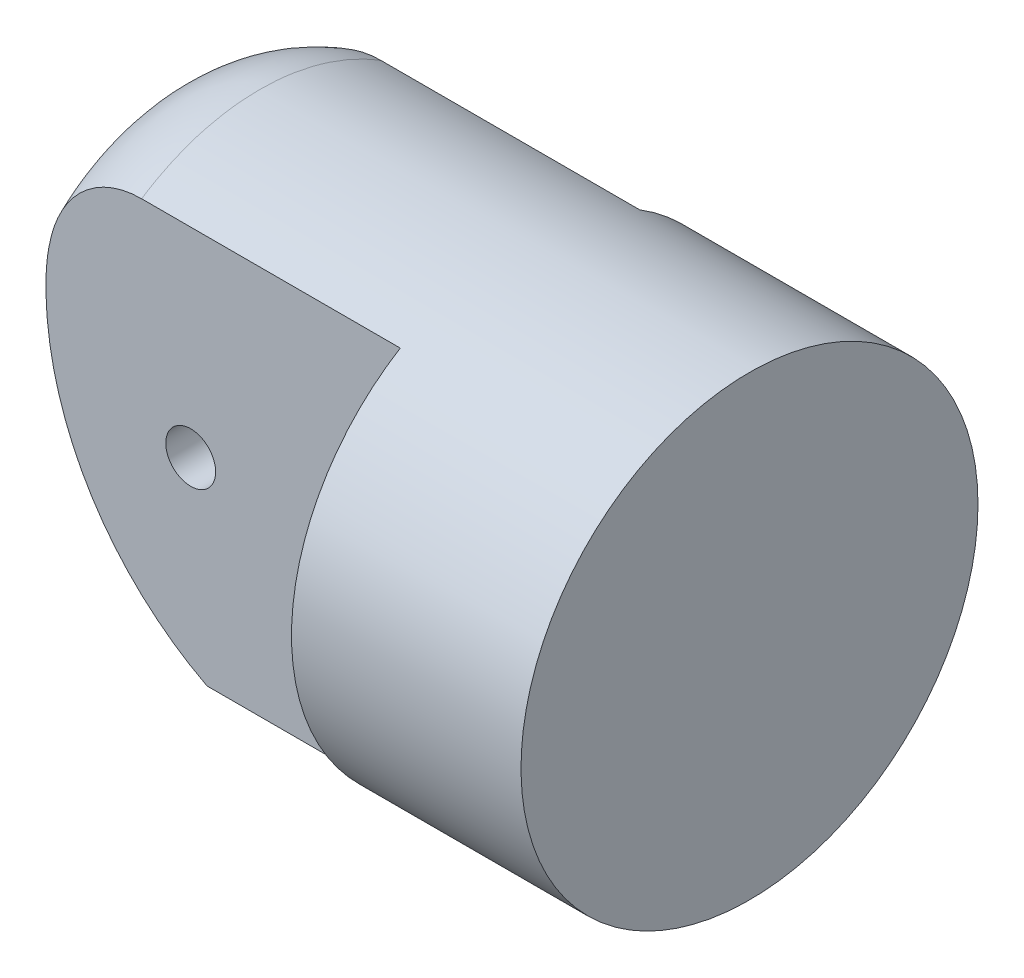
ISO-10303-21;
HEADER;
FILE_DESCRIPTION(('STEP AP214'),'2;1');
FILE_NAME('part.step','',(''),(''),'','','');
FILE_SCHEMA(('AUTOMOTIVE_DESIGN { 1 0 10303 214 1 1 1 1 }'));
ENDSEC;
DATA;
#1=APPLICATION_CONTEXT('core data for automotive mechanical design processes');
#2=APPLICATION_PROTOCOL_DEFINITION('international standard','automotive_design',2000,#1);
#3=PRODUCT_CONTEXT('',#1,'mechanical');
#4=PRODUCT('Part','Part','',(#3));
#5=PRODUCT_RELATED_PRODUCT_CATEGORY('part','',(#4));
#6=PRODUCT_DEFINITION_FORMATION('','',#4);
#7=PRODUCT_DEFINITION_CONTEXT('part definition',#1,'design');
#8=PRODUCT_DEFINITION('design','',#6,#7);
#9=PRODUCT_DEFINITION_SHAPE('','',#8);
#10=(LENGTH_UNIT() NAMED_UNIT(*) SI_UNIT(.MILLI.,.METRE.));
#11=(NAMED_UNIT(*) PLANE_ANGLE_UNIT() SI_UNIT($,.RADIAN.));
#12=(NAMED_UNIT(*) SI_UNIT($,.STERADIAN.) SOLID_ANGLE_UNIT());
#13=UNCERTAINTY_MEASURE_WITH_UNIT(LENGTH_MEASURE(1.E-05),#10,'distance_accuracy_value','');
#14=(GEOMETRIC_REPRESENTATION_CONTEXT(3) GLOBAL_UNCERTAINTY_ASSIGNED_CONTEXT((#13)) GLOBAL_UNIT_ASSIGNED_CONTEXT((#10,
#11,#12)) REPRESENTATION_CONTEXT('',''));
#15=CARTESIAN_POINT('',(0.,0.,0.));
#16=DIRECTION('',(0.,0.,1.));
#17=DIRECTION('',(1.,0.,0.));
#18=AXIS2_PLACEMENT_3D('',#15,#16,#17);
#19=CARTESIAN_POINT('',(-25.,11.45,-11.45));
#20=DIRECTION('',(0.996194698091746,0.0871557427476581,0.));
#21=DIRECTION('',(-0.0871557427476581,0.996194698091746,0.));
#22=AXIS2_PLACEMENT_3D('',#19,#20,#21);
#23=PLANE('',#22);
#24=DIRECTION('',(0.,0.,1.));
#25=VECTOR('',#24,1.);
#26=CARTESIAN_POINT('',(-24.1944624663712,2.24266385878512,-11.45));
#27=LINE('',#26,#25);
#28=CARTESIAN_POINT('',(-24.1944624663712,2.24266385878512,3.));
#29=VERTEX_POINT('',#28);
#30=CARTESIAN_POINT('',(-24.1944624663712,2.24266385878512,5.86757576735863));
#31=VERTEX_POINT('',#30);
#32=EDGE_CURVE('E192',#29,#31,#27,.T.);
#33=ORIENTED_EDGE('',*,*,#32,.T.);
#34=CARTESIAN_POINT('',(-23.9601291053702,-0.43577871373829,0.));
#35=DIRECTION('',(0.996194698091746,0.0871557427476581,0.));
#36=DIRECTION('',(-0.0871557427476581,0.996194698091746,0.));
#37=AXIS2_PLACEMENT_3D('',#34,#35,#36);
#38=ELLIPSE('',#37,6.47463795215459,6.45);
#39=CARTESIAN_POINT('',(-24.4596771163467,5.27408117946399,3.));
#40=VERTEX_POINT('',#39);
#41=EDGE_CURVE('E244',#31,#40,#38,.F.);
#42=ORIENTED_EDGE('',*,*,#41,.T.);
#43=DIRECTION('',(0.0871557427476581,-0.996194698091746,0.));
#44=VECTOR('',#43,1.);
#45=CARTESIAN_POINT('',(-23.0117283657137,-11.2760487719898,3.));
#46=LINE('',#45,#44);
#47=EDGE_CURVE('E170',#40,#29,#46,.T.);
#48=ORIENTED_EDGE('',*,*,#47,.T.);
#49=EDGE_LOOP('',(#33,#42,#48));
#50=FACE_BOUND('',#49,.T.);
#51=ADVANCED_FACE('F33',(#50),#23,.F.);
#52=CARTESIAN_POINT('',(-17.,-0.247948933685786,-11.45));
#53=DIRECTION('',(0.,0.,1.));
#54=DIRECTION('',(1.,0.,0.));
#55=AXIS2_PLACEMENT_3D('',#52,#53,#54);
#56=CYLINDRICAL_SURFACE('',#55,1.25);
#57=CARTESIAN_POINT('',(-17.,-0.247948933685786,3.));
#58=DIRECTION('',(0.,0.,1.));
#59=DIRECTION('',(0.,-1.,0.));
#60=AXIS2_PLACEMENT_3D('',#57,#58,#59);
#61=CIRCLE('',#60,1.25);
#62=CARTESIAN_POINT('',(-17.,-1.49794893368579,3.));
#63=VERTEX_POINT('',#62);
#64=EDGE_CURVE('E358',#63,#63,#61,.T.);
#65=ORIENTED_EDGE('',*,*,#64,.F.);
#66=EDGE_LOOP('',(#65));
#67=FACE_BOUND('',#66,.T.);
#68=CARTESIAN_POINT('',(-17.,-0.247948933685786,6.));
#69=DIRECTION('',(0.,0.,-1.));
#70=DIRECTION('',(-1.,0.,0.));
#71=AXIS2_PLACEMENT_3D('',#68,#69,#70);
#72=CIRCLE('',#71,1.25);
#73=CARTESIAN_POINT('',(-18.25,-0.247948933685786,6.));
#74=VERTEX_POINT('',#73);
#75=EDGE_CURVE('E173',#74,#74,#72,.T.);
#76=ORIENTED_EDGE('',*,*,#75,.F.);
#77=EDGE_LOOP('',(#76));
#78=FACE_BOUND('',#77,.T.);
#79=ADVANCED_FACE('F277',(#67,#78),#56,.F.);
#80=CARTESIAN_POINT('',(-25.,-11.45,-6.));
#81=DIRECTION('',(0.,0.,1.));
#82=DIRECTION('',(1.,0.,0.));
#83=AXIS2_PLACEMENT_3D('',#80,#81,#82);
#84=PLANE('',#83);
#85=CARTESIAN_POINT('',(-17.,-0.247948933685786,-6.));
#86=DIRECTION('',(0.,0.,1.));
#87=DIRECTION('',(1.,0.,0.));
#88=AXIS2_PLACEMENT_3D('',#85,#86,#87);
#89=CIRCLE('',#88,1.25);
#90=CARTESIAN_POINT('',(-15.75,-0.247948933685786,-6.));
#91=VERTEX_POINT('',#90);
#92=EDGE_CURVE('E189',#91,#91,#89,.T.);
#93=ORIENTED_EDGE('',*,*,#92,.T.);
#94=EDGE_LOOP('',(#93));
#95=FACE_BOUND('',#94,.T.);
#96=CARTESIAN_POINT('',(-9.25154199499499,3.55,-6.));
#97=DIRECTION('',(0.,0.,1.));
#98=DIRECTION('',(1.,0.,0.));
#99=AXIS2_PLACEMENT_3D('',#96,#97,#98);
#100=CIRCLE('',#99,15.);
#101=CARTESIAN_POINT('',(-16.1837449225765,-9.75205106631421,-6.));
#102=VERTEX_POINT('',#101);
#103=CARTESIAN_POINT('',(-24.1831672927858,2.11941761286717,-6.));
#104=VERTEX_POINT('',#103);
#105=EDGE_CURVE('E311',#102,#104,#100,.F.);
#106=ORIENTED_EDGE('',*,*,#105,.T.);
#107=CARTESIAN_POINT('',(-24.5244309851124,6.01422128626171,0.));
#108=CARTESIAN_POINT('',(-25.,11.45,0.));
#109=CARTESIAN_POINT('',(-19.5434574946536,11.45,0.));
#110=CARTESIAN_POINT('',(-24.5244309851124,6.01422128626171,0.28143997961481));
#111=CARTESIAN_POINT('',(-25.,11.45,0.520440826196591));
#112=CARTESIAN_POINT('',(-19.5434574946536,11.45,0.499610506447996));
#113=CARTESIAN_POINT('',(-24.5228170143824,5.9957735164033,0.562879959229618));
#114=CARTESIAN_POINT('',(-24.9968964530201,11.4145262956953,1.04073952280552));
#115=CARTESIAN_POINT('',(-19.5418435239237,11.4172516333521,0.999221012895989));
#116=CARTESIAN_POINT('',(-24.5163891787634,5.9223030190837,1.12094399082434));
#117=CARTESIAN_POINT('',(-24.9845439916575,11.2733370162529,2.07155251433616));
#118=CARTESIAN_POINT('',(-19.5354156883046,11.2868272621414,1.98989282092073));
#119=CARTESIAN_POINT('',(-24.5115749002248,5.86727556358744,1.39756741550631));
#120=CARTESIAN_POINT('',(-24.9753009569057,11.1676886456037,2.58179243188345));
#121=CARTESIAN_POINT('',(-19.530601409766,11.1891428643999,2.48095300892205));
#122=CARTESIAN_POINT('',(-24.4988292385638,5.7215919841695,1.94126612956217));
#123=CARTESIAN_POINT('',(-24.9508644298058,10.8883778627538,3.58266956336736));
#124=CARTESIAN_POINT('',(-19.5178557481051,10.9305262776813,3.44612359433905));
#125=CARTESIAN_POINT('',(-24.4908970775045,5.63092696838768,2.20833901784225));
#126=CARTESIAN_POINT('',(-24.9356822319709,10.7148445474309,4.07306123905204));
#127=CARTESIAN_POINT('',(-19.5099235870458,10.769578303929,3.92022972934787));
#128=CARTESIAN_POINT('',(-24.4720517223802,5.41552357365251,2.72836899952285));
#129=CARTESIAN_POINT('',(-24.8996886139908,10.3034356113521,5.02493096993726));
#130=CARTESIAN_POINT('',(-19.4910782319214,10.3871955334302,4.84338372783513));
#131=CARTESIAN_POINT('',(-24.4611374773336,5.2907731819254,2.98132107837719));
#132=CARTESIAN_POINT('',(-24.8788930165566,10.0657408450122,5.4862089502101));
#133=CARTESIAN_POINT('',(-19.4801639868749,10.1657394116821,5.29242268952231));
#134=CARTESIAN_POINT('',(-24.4365149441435,5.00933633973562,3.4687841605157));
#135=CARTESIAN_POINT('',(-24.8321090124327,9.53099723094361,6.37127845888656));
#136=CARTESIAN_POINT('',(-19.4555414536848,9.66613447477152,6.15776412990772));
#137=CARTESIAN_POINT('',(-24.4228054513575,4.85263612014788,3.70328715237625));
#138=CARTESIAN_POINT('',(-24.8061397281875,9.23416695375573,6.79492838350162));
#139=CARTESIAN_POINT('',(-19.4418319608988,9.38796121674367,6.57405238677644));
#140=CARTESIAN_POINT('',(-24.3928271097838,4.50998210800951,4.14984271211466));
#141=CARTESIAN_POINT('',(-24.7495453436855,8.58729017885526,7.59710103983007));
#142=CARTESIAN_POINT('',(-19.411853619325,8.77968393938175,7.36677504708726));
#143=CARTESIAN_POINT('',(-24.3765570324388,4.32401427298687,4.36188442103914));
#144=CARTESIAN_POINT('',(-24.7189412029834,8.23748324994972,7.97554911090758));
#145=CARTESIAN_POINT('',(-19.3955835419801,8.44955499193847,7.74319017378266));
#146=CARTESIAN_POINT('',(-24.3417358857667,3.92600674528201,4.75989208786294));
#147=CARTESIAN_POINT('',(-24.6536976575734,7.49174611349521,8.68076008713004));
#148=CARTESIAN_POINT('',(-19.3607623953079,7.74301449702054,8.44973091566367));
#149=CARTESIAN_POINT('',(-24.323183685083,3.71395412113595,4.94584501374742));
#150=CARTESIAN_POINT('',(-24.6190794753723,7.09605848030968,9.00751872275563));
#151=CARTESIAN_POINT('',(-19.3422101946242,7.36657999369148,8.77983339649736));
#152=CARTESIAN_POINT('',(-24.2841155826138,3.26740366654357,5.2884953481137));
#153=CARTESIAN_POINT('',(-24.5464935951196,6.26639807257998,9.60398035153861));
#154=CARTESIAN_POINT('',(-19.303142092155,6.57386639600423,9.38810414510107));
#155=CARTESIAN_POINT('',(-24.2635987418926,3.0328951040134,5.44517866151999));
#156=CARTESIAN_POINT('',(-24.508545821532,5.83265303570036,9.87374784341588));
#157=CARTESIAN_POINT('',(-19.2826252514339,6.15756825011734,9.66624739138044));
#158=CARTESIAN_POINT('',(-24.2209521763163,2.54544262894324,5.72660957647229));
#159=CARTESIAN_POINT('',(-24.4300330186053,4.93524759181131,10.3521040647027));
#160=CARTESIAN_POINT('',(-19.2399786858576,5.29224563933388,10.1658418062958));
#161=CARTESIAN_POINT('',(-24.1988217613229,2.29249082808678,5.85134340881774));
#162=CARTESIAN_POINT('',(-24.3894851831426,4.47178371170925,10.5608197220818));
#163=CARTESIAN_POINT('',(-19.2178482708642,4.84320717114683,10.3872685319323));
#164=CARTESIAN_POINT('',(-24.1533264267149,1.77247677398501,6.06674035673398));
#165=CARTESIAN_POINT('',(-24.3065328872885,3.52363463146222,10.9142155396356));
#166=CARTESIAN_POINT('',(-19.1723529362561,3.92008144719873,10.7696398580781));
#167=CARTESIAN_POINT('',(-24.1299610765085,1.50540959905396,6.1573914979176));
#168=CARTESIAN_POINT('',(-24.2641416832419,3.03910095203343,11.0590746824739));
#169=CARTESIAN_POINT('',(-19.1489875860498,3.44598545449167,10.9305632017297));
#170=CARTESIAN_POINT('',(-24.0823953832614,0.961731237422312,6.30306972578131));
#171=CARTESIAN_POINT('',(-24.1782747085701,2.05763694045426,11.2831513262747));
#172=CARTESIAN_POINT('',(-19.1014218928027,2.48085099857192,11.1891702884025));
#173=CARTESIAN_POINT('',(-24.0581948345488,0.685117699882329,6.35808797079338));
#174=CARTESIAN_POINT('',(-24.134807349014,1.56080274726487,11.3625863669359));
#175=CARTESIAN_POINT('',(-19.0772213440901,1.98980836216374,11.2868383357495));
#176=CARTESIAN_POINT('',(-24.0093725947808,0.127076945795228,6.43155545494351));
#177=CARTESIAN_POINT('',(-24.0475562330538,0.563517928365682,11.4554155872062));
#178=CARTESIAN_POINT('',(-19.028399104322,0.999177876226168,11.4172573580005));
#179=CARTESIAN_POINT('',(-23.9847508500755,-0.154350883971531,6.45));
#180=CARTESIAN_POINT('',(-24.0037754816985,0.0631016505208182,11.4690502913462));
#181=CARTESIAN_POINT('',(-19.0037773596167,0.499588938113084,11.45));
#182=CARTESIAN_POINT('',(-23.9355073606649,-0.717206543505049,6.45));
#183=CARTESIAN_POINT('',(-23.9166483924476,-0.932765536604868,11.4310220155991));
#184=CARTESIAN_POINT('',(-18.9545338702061,-0.499588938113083,11.45));
#185=CARTESIAN_POINT('',(-23.9108856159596,-0.998634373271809,6.43155545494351));
#186=CARTESIAN_POINT('',(-23.8732994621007,-1.42824607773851,11.3796059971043));
#187=CARTESIAN_POINT('',(-18.9299121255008,-0.999177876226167,11.4172573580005));
#188=CARTESIAN_POINT('',(-23.8620633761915,-1.55667512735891,6.35808797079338));
#189=CARTESIAN_POINT('',(-23.7877578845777,-2.40599078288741,11.2132828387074));
#190=CARTESIAN_POINT('',(-18.8810898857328,-1.98980836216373,11.2868383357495));
#191=CARTESIAN_POINT('',(-23.8378628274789,-1.83328866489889,6.30306972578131));
#192=CARTESIAN_POINT('',(-23.7455572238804,-2.88834654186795,11.0986126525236));
#193=CARTESIAN_POINT('',(-18.8568893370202,-2.48085099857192,11.1891702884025));
#194=CARTESIAN_POINT('',(-23.7902971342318,-2.37696702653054,6.1573914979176));
#195=CARTESIAN_POINT('',(-23.6629953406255,-3.83203318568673,10.8085629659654));
#196=CARTESIAN_POINT('',(-18.8093236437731,-3.44598545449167,10.9305632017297));
#197=CARTESIAN_POINT('',(-23.7669317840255,-2.64403420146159,6.06674035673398));
#198=CARTESIAN_POINT('',(-23.6226212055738,-4.29351166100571,10.6333950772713));
#199=CARTESIAN_POINT('',(-18.7859582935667,-3.92008144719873,10.7696398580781));
#200=CARTESIAN_POINT('',(-23.7214364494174,-3.16404825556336,5.85134340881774));
#201=CARTESIAN_POINT('',(-23.5443486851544,-5.18817066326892,10.2260139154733));
#202=CARTESIAN_POINT('',(-18.7404629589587,-4.84320717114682,10.3872685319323));
#203=CARTESIAN_POINT('',(-23.699306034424,-3.41700005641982,5.7266095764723));
#204=CARTESIAN_POINT('',(-23.5064333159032,-5.62154531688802,9.99397358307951));
#205=CARTESIAN_POINT('',(-18.7183325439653,-5.29224563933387,10.1658418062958));
#206=CARTESIAN_POINT('',(-23.6566594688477,-3.90445253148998,5.44517866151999));
#207=CARTESIAN_POINT('',(-23.4336611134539,-6.4533353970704,9.47729845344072));
#208=CARTESIAN_POINT('',(-18.675685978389,-6.15756825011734,9.66624739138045));
#209=CARTESIAN_POINT('',(-23.6361426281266,-4.13896109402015,5.2884953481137));
#210=CARTESIAN_POINT('',(-23.3987843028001,-6.85197916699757,9.19278735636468));
#211=CARTESIAN_POINT('',(-18.6551691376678,-6.57386639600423,9.38810414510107));
#212=CARTESIAN_POINT('',(-23.5970745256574,-4.58551154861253,4.94584501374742));
#213=CARTESIAN_POINT('',(-23.3326130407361,-7.60832015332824,8.5763134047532));
#214=CARTESIAN_POINT('',(-18.6161010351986,-7.36657999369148,8.77983339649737));
#215=CARTESIAN_POINT('',(-23.5785223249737,-4.79756417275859,4.75989208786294));
#216=CARTESIAN_POINT('',(-23.3012968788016,-7.96626552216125,8.24441778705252));
#217=CARTESIAN_POINT('',(-18.5975488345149,-7.74301449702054,8.44973091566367));
#218=CARTESIAN_POINT('',(-23.5437011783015,-5.19557170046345,4.36188442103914));
#219=CARTESIAN_POINT('',(-23.2427073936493,-8.63594640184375,7.53891514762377));
#220=CARTESIAN_POINT('',(-18.5627276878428,-8.44955499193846,7.74319017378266));
#221=CARTESIAN_POINT('',(-23.5274311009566,-5.38153953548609,4.14984271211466));
#222=CARTESIAN_POINT('',(-23.215411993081,-8.94793425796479,7.16531542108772));
#223=CARTESIAN_POINT('',(-18.5464576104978,-8.77968393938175,7.36677504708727));
#224=CARTESIAN_POINT('',(-23.4974527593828,-5.72419354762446,3.70328715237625));
#225=CARTESIAN_POINT('',(-23.1652576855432,-9.52120061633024,6.38265003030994));
#226=CARTESIAN_POINT('',(-18.5164792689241,-9.38796121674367,6.57405238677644));
#227=CARTESIAN_POINT('',(-23.4837432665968,-5.8808937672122,3.4687841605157));
#228=CARTESIAN_POINT('',(-23.1423777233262,-9.78271978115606,5.97353217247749));
#229=CARTESIAN_POINT('',(-18.5027697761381,-9.66613447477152,6.15776412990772));
#230=CARTESIAN_POINT('',(-23.4591207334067,-6.16233060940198,2.98132107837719));
#231=CARTESIAN_POINT('',(-23.1013784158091,-10.2513440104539,5.12649035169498));
#232=CARTESIAN_POINT('',(-18.478147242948,-10.1657394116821,5.29242268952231));
#233=CARTESIAN_POINT('',(-23.4482064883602,-6.28708100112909,2.72836899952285));
#234=CARTESIAN_POINT('',(-23.0832403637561,-10.4586628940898,4.68845904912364));
#235=CARTESIAN_POINT('',(-18.4672329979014,-10.3871955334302,4.84338372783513));
#236=CARTESIAN_POINT('',(-23.4293611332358,-6.50248439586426,2.20833901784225));
#237=CARTESIAN_POINT('',(-23.051977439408,-10.815999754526,3.79057555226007));
#238=CARTESIAN_POINT('',(-18.4483876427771,-10.769578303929,3.92022972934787));
#239=CARTESIAN_POINT('',(-23.4214289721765,-6.59314941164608,1.94126612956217));
#240=CARTESIAN_POINT('',(-23.0388373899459,-10.9661912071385,3.33056882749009));
#241=CARTESIAN_POINT('',(-18.4404554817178,-10.9305262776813,3.44612359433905));
#242=CARTESIAN_POINT('',(-23.4086833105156,-6.73883299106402,1.39756741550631));
#243=CARTESIAN_POINT('',(-23.0177500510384,-11.2072205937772,2.39595774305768));
#244=CARTESIAN_POINT('',(-18.4277098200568,-11.1891428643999,2.48095300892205));
#245=CARTESIAN_POINT('',(-23.403869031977,-6.79386044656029,1.12094399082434));
#246=CARTESIAN_POINT('',(-23.0097920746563,-11.2981806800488,1.92116272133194));
#247=CARTESIAN_POINT('',(-18.4228955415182,-11.2868272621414,1.98989282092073));
#248=CARTESIAN_POINT('',(-23.3974411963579,-6.86733094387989,0.56287995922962));
#249=CARTESIAN_POINT('',(-22.9991746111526,-11.4195388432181,0.96435051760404));
#250=CARTESIAN_POINT('',(-18.4164677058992,-11.4172516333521,0.999221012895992));
#251=CARTESIAN_POINT('',(-23.395827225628,-6.88577871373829,0.28143997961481));
#252=CARTESIAN_POINT('',(-22.9965096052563,-11.45,0.482119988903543));
#253=CARTESIAN_POINT('',(-18.4148537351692,-11.45,0.499610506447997));
#254=CARTESIAN_POINT('',(-23.395827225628,-6.88577871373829,-0.281439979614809));
#255=CARTESIAN_POINT('',(-22.9965096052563,-11.45,-0.48211998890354));
#256=CARTESIAN_POINT('',(-18.4148537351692,-11.45,-0.499610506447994));
#257=CARTESIAN_POINT('',(-23.3974411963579,-6.86733094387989,-0.562879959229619));
#258=CARTESIAN_POINT('',(-22.9991746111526,-11.4195388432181,-0.964350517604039));
#259=CARTESIAN_POINT('',(-18.4164677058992,-11.4172516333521,-0.99922101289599));
#260=CARTESIAN_POINT('',(-23.403869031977,-6.79386044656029,-1.12094399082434));
#261=CARTESIAN_POINT('',(-23.0097920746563,-11.2981806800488,-1.92116272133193));
#262=CARTESIAN_POINT('',(-18.4228955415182,-11.2868272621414,-1.98989282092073));
#263=CARTESIAN_POINT('',(-23.4086833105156,-6.73883299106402,-1.39756741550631));
#264=CARTESIAN_POINT('',(-23.0177500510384,-11.2072205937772,-2.39595774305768));
#265=CARTESIAN_POINT('',(-18.4277098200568,-11.1891428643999,-2.48095300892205));
#266=CARTESIAN_POINT('',(-23.4214289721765,-6.59314941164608,-1.94126612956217));
#267=CARTESIAN_POINT('',(-23.0388373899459,-10.9661912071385,-3.33056882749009));
#268=CARTESIAN_POINT('',(-18.4404554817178,-10.9305262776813,-3.44612359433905));
#269=CARTESIAN_POINT('',(-23.4293611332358,-6.50248439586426,-2.20833901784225));
#270=CARTESIAN_POINT('',(-23.051977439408,-10.815999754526,-3.79057555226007));
#271=CARTESIAN_POINT('',(-18.4483876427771,-10.769578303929,-3.92022972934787));
#272=CARTESIAN_POINT('',(-23.4482064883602,-6.28708100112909,-2.72836899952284));
#273=CARTESIAN_POINT('',(-23.0832403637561,-10.4586628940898,-4.68845904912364));
#274=CARTESIAN_POINT('',(-18.4672329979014,-10.3871955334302,-4.84338372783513));
#275=CARTESIAN_POINT('',(-23.4591207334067,-6.16233060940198,-2.98132107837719));
#276=CARTESIAN_POINT('',(-23.1013784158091,-10.2513440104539,-5.12649035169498));
#277=CARTESIAN_POINT('',(-18.478147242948,-10.1657394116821,-5.2924226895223));
#278=CARTESIAN_POINT('',(-23.4837432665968,-5.8808937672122,-3.4687841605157));
#279=CARTESIAN_POINT('',(-23.1423777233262,-9.78271978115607,-5.97353217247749));
#280=CARTESIAN_POINT('',(-18.5027697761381,-9.66613447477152,-6.15776412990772));
#281=CARTESIAN_POINT('',(-23.4974527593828,-5.72419354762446,-3.70328715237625));
#282=CARTESIAN_POINT('',(-23.1652576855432,-9.52120061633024,-6.38265003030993));
#283=CARTESIAN_POINT('',(-18.5164792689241,-9.38796121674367,-6.57405238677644));
#284=CARTESIAN_POINT('',(-23.5274311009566,-5.38153953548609,-4.14984271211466));
#285=CARTESIAN_POINT('',(-23.215411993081,-8.94793425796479,-7.16531542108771));
#286=CARTESIAN_POINT('',(-18.5464576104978,-8.77968393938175,-7.36677504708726));
#287=CARTESIAN_POINT('',(-23.5437011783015,-5.19557170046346,-4.36188442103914));
#288=CARTESIAN_POINT('',(-23.2427073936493,-8.63594640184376,-7.53891514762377));
#289=CARTESIAN_POINT('',(-18.5627276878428,-8.44955499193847,-7.74319017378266));
#290=CARTESIAN_POINT('',(-23.5785223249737,-4.7975641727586,-4.75989208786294));
#291=CARTESIAN_POINT('',(-23.3012968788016,-7.96626552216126,-8.24441778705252));
#292=CARTESIAN_POINT('',(-18.5975488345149,-7.74301449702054,-8.44973091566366));
#293=CARTESIAN_POINT('',(-23.5970745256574,-4.58551154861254,-4.94584501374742));
#294=CARTESIAN_POINT('',(-23.3326130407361,-7.60832015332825,-8.5763134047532));
#295=CARTESIAN_POINT('',(-18.6161010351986,-7.36657999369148,-8.77983339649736));
#296=CARTESIAN_POINT('',(-23.6361426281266,-4.13896109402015,-5.2884953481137));
#297=CARTESIAN_POINT('',(-23.3987843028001,-6.85197916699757,-9.19278735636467));
#298=CARTESIAN_POINT('',(-18.6551691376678,-6.57386639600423,-9.38810414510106));
#299=CARTESIAN_POINT('',(-23.6566594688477,-3.90445253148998,-5.44517866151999));
#300=CARTESIAN_POINT('',(-23.4336611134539,-6.45333539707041,-9.47729845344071));
#301=CARTESIAN_POINT('',(-18.675685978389,-6.15756825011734,-9.66624739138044));
#302=CARTESIAN_POINT('',(-23.699306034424,-3.41700005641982,-5.72660957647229));
#303=CARTESIAN_POINT('',(-23.5064333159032,-5.62154531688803,-9.9939735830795));
#304=CARTESIAN_POINT('',(-18.7183325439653,-5.29224563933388,-10.1658418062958));
#305=CARTESIAN_POINT('',(-23.7214364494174,-3.16404825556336,-5.85134340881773));
#306=CARTESIAN_POINT('',(-23.5443486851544,-5.18817066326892,-10.2260139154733));
#307=CARTESIAN_POINT('',(-18.7404629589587,-4.84320717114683,-10.3872685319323));
#308=CARTESIAN_POINT('',(-23.7669317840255,-2.64403420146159,-6.06674035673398));
#309=CARTESIAN_POINT('',(-23.6226212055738,-4.29351166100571,-10.6333950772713));
#310=CARTESIAN_POINT('',(-18.7859582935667,-3.92008144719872,-10.7696398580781));
#311=CARTESIAN_POINT('',(-23.7902971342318,-2.37696702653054,-6.1573914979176));
#312=CARTESIAN_POINT('',(-23.6629953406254,-3.83203318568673,-10.8085629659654));
#313=CARTESIAN_POINT('',(-18.8093236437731,-3.44598545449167,-10.9305632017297));
#314=CARTESIAN_POINT('',(-23.8378628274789,-1.83328866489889,-6.30306972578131));
#315=CARTESIAN_POINT('',(-23.7455572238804,-2.88834654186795,-11.0986126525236));
#316=CARTESIAN_POINT('',(-18.8568893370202,-2.48085099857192,-11.1891702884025));
#317=CARTESIAN_POINT('',(-23.8620633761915,-1.55667512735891,-6.35808797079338));
#318=CARTESIAN_POINT('',(-23.7877578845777,-2.40599078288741,-11.2132828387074));
#319=CARTESIAN_POINT('',(-18.8810898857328,-1.98980836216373,-11.2868383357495));
#320=CARTESIAN_POINT('',(-23.9108856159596,-0.998634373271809,-6.43155545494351));
#321=CARTESIAN_POINT('',(-23.8732994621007,-1.42824607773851,-11.3796059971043));
#322=CARTESIAN_POINT('',(-18.9299121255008,-0.999177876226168,-11.4172573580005));
#323=CARTESIAN_POINT('',(-23.9355073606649,-0.717206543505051,-6.45));
#324=CARTESIAN_POINT('',(-23.9166483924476,-0.93276553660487,-11.4310220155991));
#325=CARTESIAN_POINT('',(-18.9545338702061,-0.499588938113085,-11.45));
#326=CARTESIAN_POINT('',(-23.9847508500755,-0.154350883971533,-6.45));
#327=CARTESIAN_POINT('',(-24.0037754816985,0.0631016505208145,-11.4690502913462));
#328=CARTESIAN_POINT('',(-19.0037773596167,0.499588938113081,-11.45));
#329=CARTESIAN_POINT('',(-24.0093725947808,0.127076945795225,-6.43155545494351));
#330=CARTESIAN_POINT('',(-24.0475562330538,0.563517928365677,-11.4554155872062));
#331=CARTESIAN_POINT('',(-19.028399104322,0.999177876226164,-11.4172573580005));
#332=CARTESIAN_POINT('',(-24.0581948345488,0.685117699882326,-6.35808797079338));
#333=CARTESIAN_POINT('',(-24.134807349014,1.56080274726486,-11.3625863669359));
#334=CARTESIAN_POINT('',(-19.0772213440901,1.98980836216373,-11.2868383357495));
#335=CARTESIAN_POINT('',(-24.0823953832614,0.961731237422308,-6.30306972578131));
#336=CARTESIAN_POINT('',(-24.1782747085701,2.05763694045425,-11.2831513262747));
#337=CARTESIAN_POINT('',(-19.1014218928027,2.48085099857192,-11.1891702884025));
#338=CARTESIAN_POINT('',(-24.1299610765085,1.50540959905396,-6.1573914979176));
#339=CARTESIAN_POINT('',(-24.2641416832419,3.03910095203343,-11.0590746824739));
#340=CARTESIAN_POINT('',(-19.1489875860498,3.44598545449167,-10.9305632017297));
#341=CARTESIAN_POINT('',(-24.1533264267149,1.77247677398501,-6.06674035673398));
#342=CARTESIAN_POINT('',(-24.3065328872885,3.52363463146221,-10.9142155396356));
#343=CARTESIAN_POINT('',(-19.1723529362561,3.92008144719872,-10.7696398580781));
#344=CARTESIAN_POINT('',(-24.1988217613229,2.29249082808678,-5.85134340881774));
#345=CARTESIAN_POINT('',(-24.3894851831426,4.47178371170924,-10.5608197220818));
#346=CARTESIAN_POINT('',(-19.2178482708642,4.84320717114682,-10.3872685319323));
#347=CARTESIAN_POINT('',(-24.2209521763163,2.54544262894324,-5.72660957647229));
#348=CARTESIAN_POINT('',(-24.4300330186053,4.93524759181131,-10.3521040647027));
#349=CARTESIAN_POINT('',(-19.2399786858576,5.29224563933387,-10.1658418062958));
#350=CARTESIAN_POINT('',(-24.2635987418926,3.0328951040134,-5.44517866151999));
#351=CARTESIAN_POINT('',(-24.508545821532,5.83265303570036,-9.87374784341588));
#352=CARTESIAN_POINT('',(-19.2826252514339,6.15756825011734,-9.66624739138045));
#353=CARTESIAN_POINT('',(-24.2841155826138,3.26740366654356,-5.2884953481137));
#354=CARTESIAN_POINT('',(-24.5464935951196,6.26639807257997,-9.60398035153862));
#355=CARTESIAN_POINT('',(-19.303142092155,6.57386639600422,-9.38810414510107));
#356=CARTESIAN_POINT('',(-24.323183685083,3.71395412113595,-4.94584501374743));
#357=CARTESIAN_POINT('',(-24.6190794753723,7.09605848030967,-9.00751872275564));
#358=CARTESIAN_POINT('',(-19.3422101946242,7.36657999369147,-8.77983339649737));
#359=CARTESIAN_POINT('',(-24.3417358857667,3.92600674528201,-4.75989208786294));
#360=CARTESIAN_POINT('',(-24.6536976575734,7.4917461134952,-8.68076008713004));
#361=CARTESIAN_POINT('',(-19.3607623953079,7.74301449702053,-8.44973091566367));
#362=CARTESIAN_POINT('',(-24.3765570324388,4.32401427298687,-4.36188442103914));
#363=CARTESIAN_POINT('',(-24.7189412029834,8.23748324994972,-7.97554911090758));
#364=CARTESIAN_POINT('',(-19.3955835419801,8.44955499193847,-7.74319017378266));
#365=CARTESIAN_POINT('',(-24.3928271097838,4.50998210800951,-4.14984271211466));
#366=CARTESIAN_POINT('',(-24.7495453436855,8.58729017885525,-7.59710103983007));
#367=CARTESIAN_POINT('',(-19.411853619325,8.77968393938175,-7.36677504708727));
#368=CARTESIAN_POINT('',(-24.4228054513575,4.85263612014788,-3.70328715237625));
#369=CARTESIAN_POINT('',(-24.8061397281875,9.23416695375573,-6.79492838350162));
#370=CARTESIAN_POINT('',(-19.4418319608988,9.38796121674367,-6.57405238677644));
#371=CARTESIAN_POINT('',(-24.4365149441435,5.00933633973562,-3.46878416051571));
#372=CARTESIAN_POINT('',(-24.8321090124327,9.53099723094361,-6.37127845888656));
#373=CARTESIAN_POINT('',(-19.4555414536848,9.66613447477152,-6.15776412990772));
#374=CARTESIAN_POINT('',(-24.4611374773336,5.2907731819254,-2.9813210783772));
#375=CARTESIAN_POINT('',(-24.8788930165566,10.0657408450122,-5.4862089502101));
#376=CARTESIAN_POINT('',(-19.4801639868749,10.1657394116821,-5.29242268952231));
#377=CARTESIAN_POINT('',(-24.4720517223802,5.41552357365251,-2.72836899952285));
#378=CARTESIAN_POINT('',(-24.8996886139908,10.3034356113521,-5.02493096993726));
#379=CARTESIAN_POINT('',(-19.4910782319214,10.3871955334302,-4.84338372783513));
#380=CARTESIAN_POINT('',(-24.4908970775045,5.63092696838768,-2.20833901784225));
#381=CARTESIAN_POINT('',(-24.9356822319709,10.7148445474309,-4.07306123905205));
#382=CARTESIAN_POINT('',(-19.5099235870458,10.769578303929,-3.92022972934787));
#383=CARTESIAN_POINT('',(-24.4988292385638,5.7215919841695,-1.94126612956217));
#384=CARTESIAN_POINT('',(-24.9508644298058,10.8883778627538,-3.58266956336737));
#385=CARTESIAN_POINT('',(-19.5178557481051,10.9305262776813,-3.44612359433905));
#386=CARTESIAN_POINT('',(-24.5115749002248,5.86727556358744,-1.39756741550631));
#387=CARTESIAN_POINT('',(-24.9753009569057,11.1676886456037,-2.58179243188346));
#388=CARTESIAN_POINT('',(-19.530601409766,11.1891428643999,-2.48095300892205));
#389=CARTESIAN_POINT('',(-24.5163891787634,5.9223030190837,-1.12094399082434));
#390=CARTESIAN_POINT('',(-24.9845439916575,11.2733370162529,-2.07155251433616));
#391=CARTESIAN_POINT('',(-19.5354156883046,11.2868272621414,-1.98989282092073));
#392=CARTESIAN_POINT('',(-24.5228170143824,5.9957735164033,-0.562879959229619));
#393=CARTESIAN_POINT('',(-24.9968964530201,11.4145262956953,-1.04073952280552));
#394=CARTESIAN_POINT('',(-19.5418435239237,11.4172516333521,-0.99922101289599));
#395=CARTESIAN_POINT('',(-24.5244309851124,6.01422128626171,-0.281439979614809));
#396=CARTESIAN_POINT('',(-25.,11.45,-0.52044082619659));
#397=CARTESIAN_POINT('',(-19.5434574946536,11.45,-0.499610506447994));
#398=CARTESIAN_POINT('',(-24.5244309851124,6.01422128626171,0.));
#399=CARTESIAN_POINT('',(-25.,11.45,0.));
#400=CARTESIAN_POINT('',(-19.5434574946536,11.45,0.));
#401=(BOUNDED_SURFACE() B_SPLINE_SURFACE(3,2,((#107,#108,#109),(#110,#111,#112),(#113,#114,
#115),(#116,#117,#118),(#119,#120,#121),(#122,#123,#124),(#125,#126,#127),(#128,#129,#130),
(#131,#132,#133),(#134,#135,#136),(#137,#138,#139),(#140,#141,#142),(#143,#144,#145),(#146,#147,
#148),(#149,#150,#151),(#152,#153,#154),(#155,#156,#157),(#158,#159,#160),(#161,#162,#163),
(#164,#165,#166),(#167,#168,#169),(#170,#171,#172),(#173,#174,#175),(#176,#177,#178),(#179,#180,
#181),(#182,#183,#184),(#185,#186,#187),(#188,#189,#190),(#191,#192,#193),(#194,#195,#196),
(#197,#198,#199),(#200,#201,#202),(#203,#204,#205),(#206,#207,#208),(#209,#210,#211),(#212,#213,
#214),(#215,#216,#217),(#218,#219,#220),(#221,#222,#223),(#224,#225,#226),(#227,#228,#229),
(#230,#231,#232),(#233,#234,#235),(#236,#237,#238),(#239,#240,#241),(#242,#243,#244),(#245,#246,
#247),(#248,#249,#250),(#251,#252,#253),(#254,#255,#256),(#257,#258,#259),(#260,#261,#262),
(#263,#264,#265),(#266,#267,#268),(#269,#270,#271),(#272,#273,#274),(#275,#276,#277),(#278,#279,
#280),(#281,#282,#283),(#284,#285,#286),(#287,#288,#289),(#290,#291,#292),(#293,#294,#295),
(#296,#297,#298),(#299,#300,#301),(#302,#303,#304),(#305,#306,#307),(#308,#309,#310),(#311,#312,
#313),(#314,#315,#316),(#317,#318,#319),(#320,#321,#322),(#323,#324,#325),(#326,#327,#328),
(#329,#330,#331),(#332,#333,#334),(#335,#336,#337),(#338,#339,#340),(#341,#342,#343),(#344,#345,
#346),(#347,#348,#349),(#350,#351,#352),(#353,#354,#355),(#356,#357,#358),(#359,#360,#361),
(#362,#363,#364),(#365,#366,#367),(#368,#369,#370),(#371,#372,#373),(#374,#375,#376),(#377,#378,
#379),(#380,#381,#382),(#383,#384,#385),(#386,#387,#388),(#389,#390,#391),(#392,#393,#394),
(#395,#396,#397),(#398,#399,#400)),.UNSPECIFIED.,.T.,.F.,.F.) B_SPLINE_SURFACE_WITH_KNOTS((4,2,
2,2,2,2,2,2,2,2,2,2,2,2,2,2,2,2,2,2,2,2,2,2,2,2,2,2,2,2,2,2,2,2,2,2,2,2,2,2,2,2,2,2,2,2,2,2,4),
(3,3),(0.,0.843714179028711,1.68753743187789,2.53157135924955,3.37590313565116,4.22059955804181,
5.06570250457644,5.91122610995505,6.75715584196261,7.60344953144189,8.45004027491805,
9.29684100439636,10.1437504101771,10.9906598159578,11.8374605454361,12.6840512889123,
13.5303449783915,14.3762747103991,15.2217983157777,16.0669012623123,16.911597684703,
17.7559294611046,18.5999633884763,19.4437866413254,20.2875008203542,21.1312149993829,
21.975038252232,22.8190721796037,23.6634039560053,24.508100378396,25.3532033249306,
26.1987269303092,27.0446566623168,27.8909503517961,28.7375410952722,29.5843418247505,
30.4312512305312,31.278160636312,32.1249613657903,32.9715521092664,33.8178457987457,
34.6637755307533,35.5092991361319,36.3544020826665,37.1990985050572,38.0434302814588,
38.8874642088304,39.7312874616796,40.5750016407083),(0.,1.),
.UNSPECIFIED.) GEOMETRIC_REPRESENTATION_ITEM() RATIONAL_B_SPLINE_SURFACE(((1.,0.67559020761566,
1.),(1.,0.67559020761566,1.),(1.,0.675682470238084,1.),(1.,0.676049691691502,1.),(1.,
0.676324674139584,1.),(1.,0.677051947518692,1.),(1.,0.677504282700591,1.),(1.,0.678577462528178,
1.),(1.,0.679198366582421,1.),(1.,0.680596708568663,1.),(1.,0.681374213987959,1.),(1.,
0.683070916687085,1.),(1.,0.683990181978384,1.),(1.,0.685953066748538,1.),(1.,0.68699674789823,
1.),(1.,0.689189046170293,1.),(1.,0.690337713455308,1.),(1.,0.692718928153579,1.),(1.,
0.693951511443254,1.),(1.,0.69647831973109,1.),(1.,0.697772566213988,1.),(1.,0.700399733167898,
1.),(1.,0.701732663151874,1.),(1.,0.704413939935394,1.),(1.,0.70576228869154,1.),(1.,
0.708451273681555,1.),(1.,0.709791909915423,1.),(1.,0.712442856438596,1.),(1.,0.713753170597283,
1.),(1.,0.71632172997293,1.),(1.,0.717579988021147,1.),(1.,0.720023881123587,1.),(1.,
0.721209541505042,1.),(1.,0.723489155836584,1.),(1.,0.724583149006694,1.),(1.,0.726662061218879,
1.),(1.,0.727647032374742,1.),(1.,0.729492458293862,1.),(1.,0.730352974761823,1.),(1.,
0.731936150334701,1.),(1.,0.732658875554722,1.),(1.,0.733955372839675,1.),(1.,0.734529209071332,
1.),(1.,0.73551919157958,1.),(1.,0.735935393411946,1.),(1.,0.736603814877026,1.),(1.,
0.736856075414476,1.),(1.,0.737192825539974,1.),(1.,0.737277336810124,1.),(1.,0.737277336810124,
1.),(1.,0.737192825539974,1.),(1.,0.736856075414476,1.),(1.,0.736603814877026,1.),(1.,
0.735935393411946,1.),(1.,0.73551919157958,1.),(1.,0.734529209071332,1.),(1.,0.733955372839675,
1.),(1.,0.732658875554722,1.),(1.,0.731936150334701,1.),(1.,0.730352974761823,1.),(1.,
0.729492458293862,1.),(1.,0.727647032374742,1.),(1.,0.726662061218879,1.),(1.,0.724583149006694,
1.),(1.,0.723489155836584,1.),(1.,0.721209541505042,1.),(1.,0.720023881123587,1.),(1.,
0.717579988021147,1.),(1.,0.71632172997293,1.),(1.,0.713753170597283,1.),(1.,0.712442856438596,
1.),(1.,0.709791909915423,1.),(1.,0.708451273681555,1.),(1.,0.70576228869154,1.),(1.,
0.704413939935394,1.),(1.,0.701732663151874,1.),(1.,0.700399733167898,1.),(1.,0.697772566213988,
1.),(1.,0.69647831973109,1.),(1.,0.693951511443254,1.),(1.,0.692718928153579,1.),(1.,
0.690337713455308,1.),(1.,0.689189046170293,1.),(1.,0.68699674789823,1.),(1.,0.685953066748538,
1.),(1.,0.683990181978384,1.),(1.,0.683070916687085,1.),(1.,0.681374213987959,1.),(1.,
0.680596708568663,1.),(1.,0.679198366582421,1.),(1.,0.678577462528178,1.),(1.,0.677504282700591,
1.),(1.,0.677051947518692,1.),(1.,0.676324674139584,1.),(1.,0.676049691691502,1.),(1.,
0.675682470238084,1.),(1.,0.67559020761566,1.),(1.,0.67559020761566,1.))) REPRESENTATION_ITEM('') SURFACE());
#402=CARTESIAN_POINT('',(-24.1831672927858,2.11941761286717,-6.));
#403=CARTESIAN_POINT('',(-24.2049996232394,2.38604369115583,-6.));
#404=CARTESIAN_POINT('',(-24.2233929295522,2.65321190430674,-6.));
#405=CARTESIAN_POINT('',(-24.2479541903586,3.18924365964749,-6.));
#406=CARTESIAN_POINT('',(-24.2540681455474,3.45810949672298,-6.));
#407=CARTESIAN_POINT('',(-24.24839102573,4.00013463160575,-6.));
#408=CARTESIAN_POINT('',(-24.2363095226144,4.27329322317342,-6.));
#409=CARTESIAN_POINT('',(-24.1882962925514,4.81720668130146,-6.));
#410=CARTESIAN_POINT('',(-24.1524083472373,5.08796503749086,-6.));
#411=CARTESIAN_POINT('',(-24.0718835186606,5.51848088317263,-6.));
#412=CARTESIAN_POINT('',(-24.0362660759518,5.67993779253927,-6.));
#413=CARTESIAN_POINT('',(-23.953686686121,5.99991074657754,-6.));
#414=CARTESIAN_POINT('',(-23.906728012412,6.1584276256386,-6.));
#415=CARTESIAN_POINT('',(-23.8009421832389,6.47077039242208,-6.));
#416=CARTESIAN_POINT('',(-23.7421630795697,6.62461245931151,-6.));
#417=CARTESIAN_POINT('',(-23.6120974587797,6.92693306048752,-6.));
#418=CARTESIAN_POINT('',(-23.5408117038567,7.07541192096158,-6.));
#419=CARTESIAN_POINT('',(-23.384450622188,7.36735789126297,-6.));
#420=CARTESIAN_POINT('',(-23.2992135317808,7.51073876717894,-6.));
#421=CARTESIAN_POINT('',(-23.115580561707,7.78880761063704,-6.));
#422=CARTESIAN_POINT('',(-23.0171870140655,7.92349711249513,-6.));
#423=CARTESIAN_POINT('',(-22.8074464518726,8.18252995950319,-6.));
#424=CARTESIAN_POINT('',(-22.6960926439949,8.30686781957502,-6.));
#425=CARTESIAN_POINT('',(-22.4610952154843,8.5433273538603,-6.));
#426=CARTESIAN_POINT('',(-22.3374543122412,8.65545171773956,-6.));
#427=CARTESIAN_POINT('',(-22.0972842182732,8.85074829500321,-6.));
#428=CARTESIAN_POINT('',(-21.9822548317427,8.93576909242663,-6.));
#429=CARTESIAN_POINT('',(-21.7446756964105,9.09454022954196,-6.));
#430=CARTESIAN_POINT('',(-21.6221272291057,9.16829248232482,-6.));
#431=CARTESIAN_POINT('',(-21.3705942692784,9.3035261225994,-6.));
#432=CARTESIAN_POINT('',(-21.241617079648,9.36502105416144,-6.));
#433=CARTESIAN_POINT('',(-20.9783115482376,9.47503230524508,-6.));
#434=CARTESIAN_POINT('',(-20.8439844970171,9.52355173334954,-6.));
#435=CARTESIAN_POINT('',(-20.5058005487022,9.62694077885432,-6.));
#436=CARTESIAN_POINT('',(-20.2993897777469,9.67376680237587,-6.));
#437=CARTESIAN_POINT('',(-19.9864259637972,9.72068552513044,-6.));
#438=CARTESIAN_POINT('',(-19.8814741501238,9.73243842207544,-6.));
#439=CARTESIAN_POINT('',(-19.6709560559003,9.74812159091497,-6.));
#440=CARTESIAN_POINT('',(-19.565389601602,9.75204953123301,-6.));
#441=CARTESIAN_POINT('',(-19.4597757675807,9.75205106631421,-6.));
#442=B_SPLINE_CURVE_WITH_KNOTS('',3,(#402,#403,#404,#405,#406,#407,#408,#409,#410,#411,#412,
#413,#414,#415,#416,#417,#418,#419,#420,#421,#422,#423,#424,#425,#426,#427,#428,#429,#430,#431,
#432,#433,#434,#435,#436,#437,#438,#439,#440,#441),.UNSPECIFIED.,.F.,.F.,(4,2,2,2,2,2,2,2,2,2,2,
2,2,2,2,2,2,2,2,4),(0.,0.802940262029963,1.60940384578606,2.42887699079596,3.24684723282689,
3.74250941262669,4.23802870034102,4.73157293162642,5.22508709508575,5.72479207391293,
6.22440859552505,6.72428818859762,7.22405747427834,7.65256451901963,8.08099873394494,
8.50895688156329,8.93681240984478,9.56910881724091,9.88568840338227,10.2023623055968),.UNSPECIFIED.);
#443=CARTESIAN_POINT('',(-19.4597757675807,9.75205106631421,-6.));
#444=VERTEX_POINT('',#443);
#445=EDGE_CURVE('E12',#104,#444,#442,.T.);
#446=ORIENTED_EDGE('',*,*,#445,.T.);
#447=DIRECTION('',(-1.,0.,0.));
#448=VECTOR('',#447,1.);
#449=CARTESIAN_POINT('',(5.,9.75205106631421,-6.));
#450=LINE('',#449,#448);
#451=CARTESIAN_POINT('',(-6.5,9.75205106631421,-6.));
#452=VERTEX_POINT('',#451);
#453=EDGE_CURVE('E332',#452,#444,#450,.T.);
#454=ORIENTED_EDGE('',*,*,#453,.F.);
#455=DIRECTION('',(0.,1.,0.));
#456=VECTOR('',#455,1.);
#457=CARTESIAN_POINT('',(-6.5,-11.45,-6.));
#458=LINE('',#457,#456);
#459=CARTESIAN_POINT('',(-6.5,-9.75205106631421,-6.));
#460=VERTEX_POINT('',#459);
#461=EDGE_CURVE('E328',#460,#452,#458,.T.);
#462=ORIENTED_EDGE('',*,*,#461,.F.);
#463=DIRECTION('',(-1.,0.,0.));
#464=VECTOR('',#463,1.);
#465=CARTESIAN_POINT('',(5.,-9.75205106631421,-6.));
#466=LINE('',#465,#464);
#467=EDGE_CURVE('E318',#102,#460,#466,.F.);
#468=ORIENTED_EDGE('',*,*,#467,.F.);
#469=EDGE_LOOP('',(#106,#446,#454,#462,#468));
#470=FACE_BOUND('',#469,.T.);
#471=ADVANCED_FACE('F285',(#95,#470),#84,.F.);
#472=CARTESIAN_POINT('',(-25.,-11.45,6.));
#473=DIRECTION('',(0.,0.,-1.));
#474=DIRECTION('',(-1.,0.,0.));
#475=AXIS2_PLACEMENT_3D('',#472,#473,#474);
#476=PLANE('',#475);
#477=ORIENTED_EDGE('',*,*,#75,.T.);
#478=EDGE_LOOP('',(#477));
#479=FACE_BOUND('',#478,.T.);
#480=DIRECTION('',(-1.,0.,0.));
#481=VECTOR('',#480,1.);
#482=CARTESIAN_POINT('',(5.,9.75205106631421,5.99999999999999));
#483=LINE('',#482,#481);
#484=CARTESIAN_POINT('',(-19.4597757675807,9.75205106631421,5.99999999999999));
#485=VERTEX_POINT('',#484);
#486=CARTESIAN_POINT('',(-6.5,9.75205106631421,6.));
#487=VERTEX_POINT('',#486);
#488=EDGE_CURVE('E321',#485,#487,#483,.F.);
#489=ORIENTED_EDGE('',*,*,#488,.F.);
#490=CARTESIAN_POINT('',(-19.4597757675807,9.75205106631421,5.99999999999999));
#491=CARTESIAN_POINT('',(-19.5818707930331,9.75206951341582,6.));
#492=CARTESIAN_POINT('',(-19.7039634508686,9.74680484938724,6.));
#493=CARTESIAN_POINT('',(-19.9472293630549,9.72581856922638,6.));
#494=CARTESIAN_POINT('',(-20.0684027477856,9.7100984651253,6.));
#495=CARTESIAN_POINT('',(-20.3086344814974,9.66836555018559,6.));
#496=CARTESIAN_POINT('',(-20.427697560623,9.642379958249,6.));
#497=CARTESIAN_POINT('',(-20.6631757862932,9.58036960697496,6.));
#498=CARTESIAN_POINT('',(-20.7795909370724,9.54434486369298,6.));
#499=CARTESIAN_POINT('',(-21.0089404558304,9.46259308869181,6.));
#500=CARTESIAN_POINT('',(-21.1218755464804,9.41686808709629,6.));
#501=CARTESIAN_POINT('',(-21.3435556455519,9.31616151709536,6.));
#502=CARTESIAN_POINT('',(-21.4522990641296,9.26117647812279,6.));
#503=CARTESIAN_POINT('',(-21.7711234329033,9.08309031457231,6.));
#504=CARTESIAN_POINT('',(-21.974003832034,8.94678420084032,6.));
#505=CARTESIAN_POINT('',(-22.3601889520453,8.64040669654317,6.));
#506=CARTESIAN_POINT('',(-22.5429061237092,8.46960264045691,6.));
#507=CARTESIAN_POINT('',(-22.8802124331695,8.10214734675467,6.));
#508=CARTESIAN_POINT('',(-23.0347867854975,7.90548261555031,6.));
#509=CARTESIAN_POINT('',(-23.3282587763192,7.47173172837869,6.));
#510=CARTESIAN_POINT('',(-23.4640735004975,7.23257087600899,6.));
#511=CARTESIAN_POINT('',(-23.7003239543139,6.73767255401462,6.));
#512=CARTESIAN_POINT('',(-23.8007698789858,6.48193988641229,6.));
#513=CARTESIAN_POINT('',(-23.9521325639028,6.01157192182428,6.));
#514=CARTESIAN_POINT('',(-24.0089091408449,5.79876983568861,6.));
#515=CARTESIAN_POINT('',(-24.1031609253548,5.36885982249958,6.));
#516=CARTESIAN_POINT('',(-24.1406253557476,5.15174956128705,6.));
#517=CARTESIAN_POINT('',(-24.1986516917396,4.71442257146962,6.));
#518=CARTESIAN_POINT('',(-24.2191411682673,4.4941965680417,6.));
#519=CARTESIAN_POINT('',(-24.2456563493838,4.05284958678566,6.));
#520=CARTESIAN_POINT('',(-24.2516766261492,3.83172830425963,6.));
#521=CARTESIAN_POINT('',(-24.2522003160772,3.36062030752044,6.));
#522=CARTESIAN_POINT('',(-24.2450941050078,3.1106415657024,6.));
#523=CARTESIAN_POINT('',(-24.2206325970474,2.61343929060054,6.));
#524=CARTESIAN_POINT('',(-24.2033712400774,2.36621140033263,6.));
#525=CARTESIAN_POINT('',(-24.1831672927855,2.11941761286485,6.));
#526=B_SPLINE_CURVE_WITH_KNOTS('',3,(#490,#491,#492,#493,#494,#495,#496,#497,#498,#499,#500,
#501,#502,#503,#504,#505,#506,#507,#508,#509,#510,#511,#512,#513,#514,#515,#516,#517,#518,#519,
#520,#521,#522,#523,#524,#525),.UNSPECIFIED.,.F.,.F.,(4,2,2,2,2,2,2,2,2,2,2,2,2,2,2,2,2,4),(0.,
0.366167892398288,0.732282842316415,1.09743348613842,1.46258354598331,1.82765726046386,
2.1928681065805,2.92264308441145,3.66995441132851,4.41765722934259,5.23963978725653,
6.06138521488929,6.72118257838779,7.38134774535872,8.04431541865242,8.70753175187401,
9.45750791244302,10.2006531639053),.UNSPECIFIED.);
#527=CARTESIAN_POINT('',(-24.1831672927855,2.11941761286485,6.00000000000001));
#528=VERTEX_POINT('',#527);
#529=EDGE_CURVE('E233',#485,#528,#526,.T.);
#530=ORIENTED_EDGE('',*,*,#529,.T.);
#531=CARTESIAN_POINT('',(-9.25154199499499,3.55,6.));
#532=DIRECTION('',(0.,0.,-1.));
#533=DIRECTION('',(-1.,0.,0.));
#534=AXIS2_PLACEMENT_3D('',#531,#532,#533);
#535=CIRCLE('',#534,15.);
#536=CARTESIAN_POINT('',(-16.1837449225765,-9.75205106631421,6.));
#537=VERTEX_POINT('',#536);
#538=EDGE_CURVE('E342',#528,#537,#535,.F.);
#539=ORIENTED_EDGE('',*,*,#538,.T.);
#540=DIRECTION('',(-1.,0.,0.));
#541=VECTOR('',#540,1.);
#542=CARTESIAN_POINT('',(5.,-9.75205106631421,5.99999999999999));
#543=LINE('',#542,#541);
#544=CARTESIAN_POINT('',(-6.5,-9.75205106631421,6.));
#545=VERTEX_POINT('',#544);
#546=EDGE_CURVE('E325',#545,#537,#543,.T.);
#547=ORIENTED_EDGE('',*,*,#546,.F.);
#548=DIRECTION('',(0.,1.,0.));
#549=VECTOR('',#548,1.);
#550=CARTESIAN_POINT('',(-6.5,-11.45,6.));
#551=LINE('',#550,#549);
#552=EDGE_CURVE('E319',#545,#487,#551,.T.);
#553=ORIENTED_EDGE('',*,*,#552,.T.);
#554=EDGE_LOOP('',(#489,#530,#539,#547,#553));
#555=FACE_BOUND('',#554,.T.);
#556=ADVANCED_FACE('F219',(#479,#555),#476,.F.);
#557=CARTESIAN_POINT('',(5.,0.,0.));
#558=DIRECTION('',(-1.,0.,0.));
#559=DIRECTION('',(0.,0.,1.));
#560=AXIS2_PLACEMENT_3D('',#557,#558,#559);
#561=CYLINDRICAL_SURFACE('',#560,11.45);
#562=ORIENTED_EDGE('',*,*,#453,.T.);
#563=CARTESIAN_POINT('',(-18.9791556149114,0.,0.));
#564=DIRECTION('',(-0.998787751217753,-0.0492242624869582,0.));
#565=DIRECTION('',(-0.0492242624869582,0.998787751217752,0.));
#566=AXIS2_PLACEMENT_3D('',#563,#564,#565);
#567=ELLIPSE('',#566,11.4638970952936,11.45);
#568=EDGE_CURVE('E344',#444,#485,#567,.F.);
#569=ORIENTED_EDGE('',*,*,#568,.T.);
#570=ORIENTED_EDGE('',*,*,#488,.T.);
#571=CARTESIAN_POINT('',(-6.5,0.,0.));
#572=DIRECTION('',(1.,0.,0.));
#573=DIRECTION('',(0.,0.,-1.));
#574=AXIS2_PLACEMENT_3D('',#571,#572,#573);
#575=CIRCLE('',#574,11.45);
#576=EDGE_CURVE('E339',#487,#545,#575,.T.);
#577=ORIENTED_EDGE('',*,*,#576,.T.);
#578=ORIENTED_EDGE('',*,*,#546,.T.);
#579=CARTESIAN_POINT('',(-24.1944624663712,2.24266385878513,11.2282215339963));
#580=CARTESIAN_POINT('',(-24.182569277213,2.10670241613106,11.255379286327));
#581=CARTESIAN_POINT('',(-24.1687742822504,1.970425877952,11.2800281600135));
#582=CARTESIAN_POINT('',(-24.1373449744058,1.69750639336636,11.3243137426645));
#583=CARTESIAN_POINT('',(-24.1197107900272,1.56086345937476,11.3439506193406));
#584=CARTESIAN_POINT('',(-24.0610245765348,1.15097698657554,11.3953277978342));
#585=CARTESIAN_POINT('',(-24.0141707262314,0.877566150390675,11.4195763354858));
#586=CARTESIAN_POINT('',(-23.9055032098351,0.33479941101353,11.4483088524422));
#587=CARTESIAN_POINT('',(-23.8437998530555,0.0654284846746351,11.4529340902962));
#588=CARTESIAN_POINT('',(-23.7056855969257,-0.469198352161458,11.4435060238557));
#589=CARTESIAN_POINT('',(-23.6292735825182,-0.734453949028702,11.4294513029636));
#590=CARTESIAN_POINT('',(-23.4626201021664,-1.25839821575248,11.3836708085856));
#591=CARTESIAN_POINT('',(-23.372407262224,-1.51709921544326,11.3519812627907));
#592=CARTESIAN_POINT('',(-23.1788877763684,-2.02704739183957,11.2720993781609));
#593=CARTESIAN_POINT('',(-23.075575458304,-2.27829128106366,11.2238998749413));
#594=CARTESIAN_POINT('',(-22.856745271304,-2.77230426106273,11.1122028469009));
#595=CARTESIAN_POINT('',(-22.7412110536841,-3.01506140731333,11.0486846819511));
#596=CARTESIAN_POINT('',(-22.4990993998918,-3.49084617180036,10.9077077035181));
#597=CARTESIAN_POINT('',(-22.3725195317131,-3.72387163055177,10.8302458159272));
#598=CARTESIAN_POINT('',(-22.060025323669,-4.26495736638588,10.6312751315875));
#599=CARTESIAN_POINT('',(-21.8696577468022,-4.56839519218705,10.5041405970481));
#600=CARTESIAN_POINT('',(-21.4726573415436,-5.15458309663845,10.2292550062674));
#601=CARTESIAN_POINT('',(-21.2660193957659,-5.4373266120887,10.0814974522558));
#602=CARTESIAN_POINT('',(-20.8385852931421,-5.98207459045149,9.76811907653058));
#603=CARTESIAN_POINT('',(-20.6177703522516,-6.24405046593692,9.60247434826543));
#604=CARTESIAN_POINT('',(-20.1643384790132,-6.74686917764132,9.25610478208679));
#605=CARTESIAN_POINT('',(-19.9317211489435,-6.98771130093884,9.07537943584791));
#606=CARTESIAN_POINT('',(-19.3648284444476,-7.53746084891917,8.62892746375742));
#607=CARTESIAN_POINT('',(-19.0259282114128,-7.83682341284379,8.35728698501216));
#608=CARTESIAN_POINT('',(-18.3328424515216,-8.39690925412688,7.79436691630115));
#609=CARTESIAN_POINT('',(-17.9786512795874,-8.65761810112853,7.50308005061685));
#610=CARTESIAN_POINT('',(-17.2576128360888,-9.1421948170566,6.90444091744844));
#611=CARTESIAN_POINT('',(-16.8907447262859,-9.36599816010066,6.59706172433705));
#612=CARTESIAN_POINT('',(-16.1475762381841,-9.77760841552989,5.97005120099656));
#613=CARTESIAN_POINT('',(-15.7712762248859,-9.96541671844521,5.65042034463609));
#614=CARTESIAN_POINT('',(-14.8962040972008,-10.357992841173,4.90331656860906));
#615=CARTESIAN_POINT('',(-14.3948488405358,-10.5506769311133,4.47249474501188));
#616=CARTESIAN_POINT('',(-13.3833582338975,-10.8795192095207,3.59947486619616));
#617=CARTESIAN_POINT('',(-12.8732191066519,-11.0156524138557,3.15727187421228));
#618=CARTESIAN_POINT('',(-11.8487025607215,-11.2327045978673,2.26680512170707));
#619=CARTESIAN_POINT('',(-11.3343372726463,-11.3137472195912,1.81855725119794));
#620=CARTESIAN_POINT('',(-10.3032405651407,-11.4220525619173,0.918851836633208));
#621=CARTESIAN_POINT('',(-9.78651109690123,-11.4493536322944,0.46739681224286));
#622=CARTESIAN_POINT('',(-9.26383947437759,-11.4499962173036,0.0107441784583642));
#623=CARTESIAN_POINT('',(-9.25769071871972,-11.4499999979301,0.00537207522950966));
#624=CARTESIAN_POINT('',(-9.25154199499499,-11.45,0.));
#625=B_SPLINE_CURVE_WITH_KNOTS('',3,(#579,#580,#581,#582,#583,#584,#585,#586,#587,#588,#589,
#590,#591,#592,#593,#594,#595,#596,#597,#598,#599,#600,#601,#602,#603,#604,#605,#606,#607,#608,
#609,#610,#611,#612,#613,#614,#615,#616,#617,#618,#619,#620,#621,#622,#623,#624),.UNSPECIFIED.,
.F.,.F.,(4,2,2,2,2,2,2,2,2,2,2,2,2,2,2,2,2,2,2,2,2,2,4),(0.,0.41739487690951,0.834775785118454,
1.66889650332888,2.49700249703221,3.32517129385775,4.15164500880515,4.97847782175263,
5.80643098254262,6.63456690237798,7.77318156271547,8.9121557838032,10.0526715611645,
11.1932257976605,12.7733902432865,14.3541431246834,15.9376311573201,17.5210580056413,
19.583935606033,21.6477236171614,23.7068643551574,25.764535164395,25.7890300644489),.UNSPECIFIED.);
#626=CARTESIAN_POINT('',(-9.25154199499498,-11.45,0.));
#627=VERTEX_POINT('',#626);
#628=EDGE_CURVE('E195',#537,#627,#625,.T.);
#629=ORIENTED_EDGE('',*,*,#628,.T.);
#630=CARTESIAN_POINT('',(-24.1944624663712,2.24266385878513,-11.2282215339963));
#631=CARTESIAN_POINT('',(-24.182569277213,2.10670241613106,-11.255379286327));
#632=CARTESIAN_POINT('',(-24.1687742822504,1.970425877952,-11.2800281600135));
#633=CARTESIAN_POINT('',(-24.1373449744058,1.69750639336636,-11.3243137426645));
#634=CARTESIAN_POINT('',(-24.1197107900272,1.56086345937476,-11.3439506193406));
#635=CARTESIAN_POINT('',(-24.0610245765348,1.15097698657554,-11.3953277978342));
#636=CARTESIAN_POINT('',(-24.0141707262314,0.877566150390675,-11.4195763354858));
#637=CARTESIAN_POINT('',(-23.9055032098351,0.33479941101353,-11.4483088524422));
#638=CARTESIAN_POINT('',(-23.8437998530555,0.0654284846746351,-11.4529340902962));
#639=CARTESIAN_POINT('',(-23.7056855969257,-0.469198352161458,-11.4435060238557));
#640=CARTESIAN_POINT('',(-23.6292735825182,-0.734453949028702,-11.4294513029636));
#641=CARTESIAN_POINT('',(-23.4626201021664,-1.25839821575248,-11.3836708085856));
#642=CARTESIAN_POINT('',(-23.372407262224,-1.51709921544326,-11.3519812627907));
#643=CARTESIAN_POINT('',(-23.1788877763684,-2.02704739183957,-11.2720993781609));
#644=CARTESIAN_POINT('',(-23.075575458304,-2.27829128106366,-11.2238998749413));
#645=CARTESIAN_POINT('',(-22.856745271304,-2.77230426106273,-11.1122028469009));
#646=CARTESIAN_POINT('',(-22.7412110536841,-3.01506140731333,-11.0486846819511));
#647=CARTESIAN_POINT('',(-22.4990993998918,-3.49084617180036,-10.9077077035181));
#648=CARTESIAN_POINT('',(-22.3725195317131,-3.72387163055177,-10.8302458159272));
#649=CARTESIAN_POINT('',(-22.060025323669,-4.26495736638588,-10.6312751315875));
#650=CARTESIAN_POINT('',(-21.8696577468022,-4.56839519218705,-10.5041405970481));
#651=CARTESIAN_POINT('',(-21.4726573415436,-5.15458309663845,-10.2292550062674));
#652=CARTESIAN_POINT('',(-21.2660193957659,-5.4373266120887,-10.0814974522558));
#653=CARTESIAN_POINT('',(-20.8385852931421,-5.98207459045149,-9.76811907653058));
#654=CARTESIAN_POINT('',(-20.6177703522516,-6.24405046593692,-9.60247434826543));
#655=CARTESIAN_POINT('',(-20.1643384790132,-6.74686917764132,-9.25610478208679));
#656=CARTESIAN_POINT('',(-19.9317211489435,-6.98771130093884,-9.07537943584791));
#657=CARTESIAN_POINT('',(-19.3648284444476,-7.53746084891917,-8.62892746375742));
#658=CARTESIAN_POINT('',(-19.0259282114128,-7.83682341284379,-8.35728698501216));
#659=CARTESIAN_POINT('',(-18.3328424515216,-8.39690925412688,-7.79436691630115));
#660=CARTESIAN_POINT('',(-17.9786512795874,-8.65761810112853,-7.50308005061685));
#661=CARTESIAN_POINT('',(-17.2576128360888,-9.1421948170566,-6.90444091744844));
#662=CARTESIAN_POINT('',(-16.8907447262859,-9.36599816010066,-6.59706172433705));
#663=CARTESIAN_POINT('',(-16.1475762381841,-9.77760841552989,-5.97005120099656));
#664=CARTESIAN_POINT('',(-15.7712762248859,-9.96541671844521,-5.65042034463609));
#665=CARTESIAN_POINT('',(-14.8962040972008,-10.357992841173,-4.90331656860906));
#666=CARTESIAN_POINT('',(-14.3948488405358,-10.5506769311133,-4.47249474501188));
#667=CARTESIAN_POINT('',(-13.3833582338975,-10.8795192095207,-3.59947486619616));
#668=CARTESIAN_POINT('',(-12.8732191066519,-11.0156524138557,-3.15727187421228));
#669=CARTESIAN_POINT('',(-11.8487025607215,-11.2327045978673,-2.26680512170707));
#670=CARTESIAN_POINT('',(-11.3343372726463,-11.3137472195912,-1.81855725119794));
#671=CARTESIAN_POINT('',(-10.3032405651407,-11.4220525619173,-0.918851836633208));
#672=CARTESIAN_POINT('',(-9.78651109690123,-11.4493536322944,-0.46739681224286));
#673=CARTESIAN_POINT('',(-9.26383947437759,-11.4499962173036,-0.0107441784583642));
#674=CARTESIAN_POINT('',(-9.25769071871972,-11.4499999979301,-0.00537207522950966));
#675=CARTESIAN_POINT('',(-9.25154199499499,-11.45,0.));
#676=B_SPLINE_CURVE_WITH_KNOTS('',3,(#630,#631,#632,#633,#634,#635,#636,#637,#638,#639,#640,
#641,#642,#643,#644,#645,#646,#647,#648,#649,#650,#651,#652,#653,#654,#655,#656,#657,#658,#659,
#660,#661,#662,#663,#664,#665,#666,#667,#668,#669,#670,#671,#672,#673,#674,#675),.UNSPECIFIED.,
.F.,.F.,(4,2,2,2,2,2,2,2,2,2,2,2,2,2,2,2,2,2,2,2,2,2,4),(0.,0.41739487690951,0.834775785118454,
1.66889650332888,2.49700249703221,3.32517129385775,4.15164500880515,4.97847782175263,
5.80643098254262,6.63456690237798,7.77318156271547,8.9121557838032,10.0526715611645,
11.1932257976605,12.7733902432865,14.3541431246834,15.9376311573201,17.5210580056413,
19.583935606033,21.6477236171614,23.7068643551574,25.764535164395,25.7890300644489),.UNSPECIFIED.);
#677=EDGE_CURVE('E202',#627,#102,#676,.F.);
#678=ORIENTED_EDGE('',*,*,#677,.T.);
#679=ORIENTED_EDGE('',*,*,#467,.T.);
#680=CARTESIAN_POINT('',(-6.5,0.,0.));
#681=DIRECTION('',(1.,0.,0.));
#682=DIRECTION('',(0.,0.,-1.));
#683=AXIS2_PLACEMENT_3D('',#680,#681,#682);
#684=CIRCLE('',#683,11.45);
#685=EDGE_CURVE('E337',#460,#452,#684,.T.);
#686=ORIENTED_EDGE('',*,*,#685,.T.);
#687=EDGE_LOOP('',(#562,#569,#570,#577,#578,#629,#678,#679,#686));
#688=FACE_BOUND('',#687,.T.);
#689=CARTESIAN_POINT('',(5.,0.,0.));
#690=DIRECTION('',(1.,0.,0.));
#691=DIRECTION('',(0.,0.,-1.));
#692=AXIS2_PLACEMENT_3D('',#689,#690,#691);
#693=CIRCLE('',#692,11.45);
#694=CARTESIAN_POINT('',(5.,0.,-11.45));
#695=VERTEX_POINT('',#694);
#696=EDGE_CURVE('E334',#695,#695,#693,.T.);
#697=ORIENTED_EDGE('',*,*,#696,.F.);
#698=EDGE_LOOP('',(#697));
#699=FACE_BOUND('',#698,.T.);
#700=ADVANCED_FACE('F207',(#688,#699),#561,.T.);
#701=CARTESIAN_POINT('',(5.,0.,0.));
#702=DIRECTION('',(1.,0.,0.));
#703=DIRECTION('',(0.,0.,-1.));
#704=AXIS2_PLACEMENT_3D('',#701,#702,#703);
#705=PLANE('',#704);
#706=ORIENTED_EDGE('',*,*,#696,.T.);
#707=EDGE_LOOP('',(#706));
#708=FACE_BOUND('',#707,.T.);
#709=ADVANCED_FACE('F442',(#708),#705,.T.);
#710=CARTESIAN_POINT('',(-6.5,-11.45,-11.45));
#711=DIRECTION('',(1.,0.,0.));
#712=DIRECTION('',(0.,0.,-1.));
#713=AXIS2_PLACEMENT_3D('',#710,#711,#712);
#714=PLANE('',#713);
#715=ORIENTED_EDGE('',*,*,#685,.F.);
#716=ORIENTED_EDGE('',*,*,#461,.T.);
#717=EDGE_LOOP('',(#715,#716));
#718=FACE_BOUND('',#717,.T.);
#719=ADVANCED_FACE('F298',(#718),#714,.F.);
#720=CARTESIAN_POINT('',(-6.5,-11.45,11.45));
#721=DIRECTION('',(1.,0.,0.));
#722=DIRECTION('',(0.,0.,-1.));
#723=AXIS2_PLACEMENT_3D('',#720,#721,#722);
#724=PLANE('',#723);
#725=ORIENTED_EDGE('',*,*,#552,.F.);
#726=ORIENTED_EDGE('',*,*,#576,.F.);
#727=EDGE_LOOP('',(#725,#726));
#728=FACE_BOUND('',#727,.T.);
#729=ADVANCED_FACE('F293',(#728),#724,.F.);
#730=DIRECTION('',(-0.0871557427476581,0.996194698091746,0.));
#731=VECTOR('',#730,1.);
#732=CARTESIAN_POINT('',(-23.0117283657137,-11.2760487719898,-3.));
#733=LINE('',#732,#731);
#734=CARTESIAN_POINT('',(-24.1944624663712,2.24266385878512,-3.));
#735=VERTEX_POINT('',#734);
#736=CARTESIAN_POINT('',(-24.4596771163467,5.27408117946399,-3.));
#737=VERTEX_POINT('',#736);
#738=EDGE_CURVE('E185',#735,#737,#733,.T.);
#739=ORIENTED_EDGE('',*,*,#738,.T.);
#740=CARTESIAN_POINT('',(-23.9601291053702,-0.43577871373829,0.));
#741=DIRECTION('',(0.996194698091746,0.0871557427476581,0.));
#742=DIRECTION('',(-0.0871557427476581,0.996194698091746,0.));
#743=AXIS2_PLACEMENT_3D('',#740,#741,#742);
#744=ELLIPSE('',#743,6.47463795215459,6.45);
#745=CARTESIAN_POINT('',(-24.1944624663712,2.24266385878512,-5.86757576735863));
#746=VERTEX_POINT('',#745);
#747=EDGE_CURVE('E242',#737,#746,#744,.F.);
#748=ORIENTED_EDGE('',*,*,#747,.T.);
#749=EDGE_CURVE('E193',#746,#735,#27,.T.);
#750=ORIENTED_EDGE('',*,*,#749,.T.);
#751=EDGE_LOOP('',(#739,#748,#750));
#752=FACE_BOUND('',#751,.T.);
#753=ADVANCED_FACE('F215',(#752),#23,.F.);
#754=CARTESIAN_POINT('',(-9.25154199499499,3.55,-11.45));
#755=DIRECTION('',(0.,0.,1.));
#756=DIRECTION('',(1.,0.,0.));
#757=AXIS2_PLACEMENT_3D('',#754,#755,#756);
#758=CYLINDRICAL_SURFACE('',#757,15.);
#759=ORIENTED_EDGE('',*,*,#538,.F.);
#760=CARTESIAN_POINT('',(-24.1831672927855,2.11941761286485,6.00000000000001));
#761=CARTESIAN_POINT('',(-24.1865601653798,2.1548551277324,5.96257324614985));
#762=CARTESIAN_POINT('',(-24.1898040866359,2.19002106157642,5.92488284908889));
#763=CARTESIAN_POINT('',(-24.193424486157,2.23083938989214,5.88048539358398));
#764=CARTESIAN_POINT('',(-24.1939456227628,2.23675553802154,5.87403437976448));
#765=CARTESIAN_POINT('',(-24.1944624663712,2.24266385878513,5.86757576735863));
#766=B_SPLINE_CURVE_WITH_KNOTS('',3,(#760,#761,#762,#763,#764,#765),.UNSPECIFIED.,.F.,.F.,(4,2,
4),(0.,0.154950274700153,0.181256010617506),.UNSPECIFIED.);
#767=EDGE_CURVE('E232',#528,#31,#766,.T.);
#768=ORIENTED_EDGE('',*,*,#767,.T.);
#769=ORIENTED_EDGE('',*,*,#32,.F.);
#770=CARTESIAN_POINT('',(-9.25154199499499,3.55,3.));
#771=DIRECTION('',(0.,0.,1.));
#772=DIRECTION('',(0.,-1.,0.));
#773=AXIS2_PLACEMENT_3D('',#770,#771,#772);
#774=CIRCLE('',#773,15.);
#775=CARTESIAN_POINT('',(-18.5945243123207,-8.18493423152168,3.00000000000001));
#776=VERTEX_POINT('',#775);
#777=EDGE_CURVE('E354',#776,#29,#774,.F.);
#778=ORIENTED_EDGE('',*,*,#777,.F.);
#779=DIRECTION('',(0.,0.,1.));
#780=VECTOR('',#779,1.);
#781=CARTESIAN_POINT('',(-18.5945243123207,-8.18493423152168,-11.45));
#782=LINE('',#781,#780);
#783=CARTESIAN_POINT('',(-18.5945243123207,-8.18493423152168,-3.));
#784=VERTEX_POINT('',#783);
#785=EDGE_CURVE('E150',#784,#776,#782,.T.);
#786=ORIENTED_EDGE('',*,*,#785,.F.);
#787=CARTESIAN_POINT('',(-9.25154199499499,3.55,-3.));
#788=DIRECTION('',(0.,0.,-1.));
#789=DIRECTION('',(-1.,0.,0.));
#790=AXIS2_PLACEMENT_3D('',#787,#788,#789);
#791=CIRCLE('',#790,15.);
#792=EDGE_CURVE('E360',#735,#784,#791,.F.);
#793=ORIENTED_EDGE('',*,*,#792,.F.);
#794=ORIENTED_EDGE('',*,*,#749,.F.);
#795=CARTESIAN_POINT('',(-24.1831672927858,2.11941761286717,-6.));
#796=CARTESIAN_POINT('',(-24.1865601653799,2.15485512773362,-5.96257324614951));
#797=CARTESIAN_POINT('',(-24.189804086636,2.19002106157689,-5.92488284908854));
#798=CARTESIAN_POINT('',(-24.193424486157,2.23083938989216,-5.88048539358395));
#799=CARTESIAN_POINT('',(-24.1939456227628,2.23675553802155,-5.87403437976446));
#800=CARTESIAN_POINT('',(-24.1944624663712,2.24266385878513,-5.86757576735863));
#801=B_SPLINE_CURVE_WITH_KNOTS('',3,(#795,#796,#797,#798,#799,#800),.UNSPECIFIED.,.F.,.F.,(4,2,
4),(0.,0.154950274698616,0.181256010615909),.UNSPECIFIED.);
#802=EDGE_CURVE('E227',#746,#104,#801,.F.);
#803=ORIENTED_EDGE('',*,*,#802,.T.);
#804=ORIENTED_EDGE('',*,*,#105,.F.);
#805=ORIENTED_EDGE('',*,*,#677,.F.);
#806=ORIENTED_EDGE('',*,*,#628,.F.);
#807=EDGE_LOOP('',(#759,#768,#769,#778,#786,#793,#794,#803,#804,#805,#806));
#808=FACE_BOUND('',#807,.T.);
#809=ADVANCED_FACE('F210',(#808),#758,.T.);
#810=CARTESIAN_POINT('',(-17.,-0.247948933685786,-3.));
#811=DIRECTION('',(0.,0.,-1.));
#812=DIRECTION('',(-1.,0.,0.));
#813=AXIS2_PLACEMENT_3D('',#810,#811,#812);
#814=CIRCLE('',#813,1.25);
#815=CARTESIAN_POINT('',(-18.25,-0.247948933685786,-3.));
#816=VERTEX_POINT('',#815);
#817=EDGE_CURVE('E355',#816,#816,#814,.T.);
#818=ORIENTED_EDGE('',*,*,#817,.F.);
#819=EDGE_LOOP('',(#818));
#820=FACE_BOUND('',#819,.T.);
#821=ORIENTED_EDGE('',*,*,#92,.F.);
#822=EDGE_LOOP('',(#821));
#823=FACE_BOUND('',#822,.T.);
#824=ADVANCED_FACE('F214',(#820,#823),#56,.F.);
#825=CARTESIAN_POINT('',(-25.,-11.45,-3.));
#826=DIRECTION('',(0.,0.,1.));
#827=DIRECTION('',(1.,0.,0.));
#828=AXIS2_PLACEMENT_3D('',#825,#826,#827);
#829=PLANE('',#828);
#830=DIRECTION('',(-1.,0.,0.));
#831=VECTOR('',#830,1.);
#832=CARTESIAN_POINT('',(-3.5,7.8995253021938,-3.));
#833=LINE('',#832,#831);
#834=CARTESIAN_POINT('',(-3.5,7.8995253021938,-3.));
#835=VERTEX_POINT('',#834);
#836=CARTESIAN_POINT('',(-24.0908871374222,7.8995253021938,-3.));
#837=VERTEX_POINT('',#836);
#838=EDGE_CURVE('E367',#835,#837,#833,.T.);
#839=ORIENTED_EDGE('',*,*,#838,.T.);
#840=CARTESIAN_POINT('',(-24.0908871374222,7.8995253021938,-3.));
#841=CARTESIAN_POINT('',(-24.1512250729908,7.74885232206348,-3.));
#842=CARTESIAN_POINT('',(-24.2045672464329,7.59541827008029,-3.));
#843=CARTESIAN_POINT('',(-24.297262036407,7.28441702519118,-3.));
#844=CARTESIAN_POINT('',(-24.336618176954,7.12685088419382,-3.));
#845=CARTESIAN_POINT('',(-24.4007662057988,6.81187792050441,-3.));
#846=CARTESIAN_POINT('',(-24.4258173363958,6.65452350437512,-3.));
#847=CARTESIAN_POINT('',(-24.4627148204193,6.33833017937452,-3.));
#848=CARTESIAN_POINT('',(-24.47456562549,6.17949178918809,-3.));
#849=CARTESIAN_POINT('',(-24.4842657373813,5.89646829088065,-3.));
#850=CARTESIAN_POINT('',(-24.4846250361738,5.77236026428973,-3.));
#851=CARTESIAN_POINT('',(-24.4778100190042,5.52341799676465,-3.));
#852=CARTESIAN_POINT('',(-24.4705792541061,5.39858527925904,-3.));
#853=CARTESIAN_POINT('',(-24.4596771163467,5.27408117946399,-3.));
#854=B_SPLINE_CURVE_WITH_KNOTS('',3,(#840,#841,#842,#843,#844,#845,#846,#847,#848,#849,#850,
#851,#852,#853),.UNSPECIFIED.,.F.,.F.,(4,2,2,2,2,2,4),(0.,0.486690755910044,0.973258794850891,
1.45070373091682,1.9279876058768,2.30009288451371,2.67498533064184),.UNSPECIFIED.);
#855=EDGE_CURVE('E44',#837,#737,#854,.T.);
#856=ORIENTED_EDGE('',*,*,#855,.T.);
#857=ORIENTED_EDGE('',*,*,#738,.F.);
#858=ORIENTED_EDGE('',*,*,#792,.T.);
#859=DIRECTION('',(-0.996194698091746,-0.0871557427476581,0.));
#860=VECTOR('',#859,1.);
#861=CARTESIAN_POINT('',(6.5266375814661,-5.98711735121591,-3.));
#862=LINE('',#861,#860);
#863=CARTESIAN_POINT('',(-13.355136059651,-7.72654715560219,-3.));
#864=VERTEX_POINT('',#863);
#865=EDGE_CURVE('E154',#864,#784,#862,.T.);
#866=ORIENTED_EDGE('',*,*,#865,.F.);
#867=CARTESIAN_POINT('',(-9.25154199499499,3.55,-3.));
#868=DIRECTION('',(0.,0.,1.));
#869=DIRECTION('',(1.,0.,0.));
#870=AXIS2_PLACEMENT_3D('',#867,#868,#869);
#871=CIRCLE('',#870,12.);
#872=CARTESIAN_POINT('',(-12.8443640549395,-7.8995253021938,-3.));
#873=VERTEX_POINT('',#872);
#874=EDGE_CURVE('E163',#873,#864,#871,.F.);
#875=ORIENTED_EDGE('',*,*,#874,.F.);
#876=DIRECTION('',(-1.,0.,0.));
#877=VECTOR('',#876,1.);
#878=CARTESIAN_POINT('',(-12.8443640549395,-7.8995253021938,-3.));
#879=LINE('',#878,#877);
#880=CARTESIAN_POINT('',(-3.5,-7.8995253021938,-3.));
#881=VERTEX_POINT('',#880);
#882=EDGE_CURVE('E369',#873,#881,#879,.F.);
#883=ORIENTED_EDGE('',*,*,#882,.T.);
#884=DIRECTION('',(0.,1.,0.));
#885=VECTOR('',#884,1.);
#886=CARTESIAN_POINT('',(-3.5,-11.45,-3.));
#887=LINE('',#886,#885);
#888=EDGE_CURVE('E370',#881,#835,#887,.T.);
#889=ORIENTED_EDGE('',*,*,#888,.T.);
#890=EDGE_LOOP('',(#839,#856,#857,#858,#866,#875,#883,#889));
#891=FACE_BOUND('',#890,.T.);
#892=ORIENTED_EDGE('',*,*,#817,.T.);
#893=EDGE_LOOP('',(#892));
#894=FACE_BOUND('',#893,.T.);
#895=ADVANCED_FACE('F261',(#891,#894),#829,.T.);
#896=CARTESIAN_POINT('',(-25.,-11.45,3.));
#897=DIRECTION('',(0.,0.,-1.));
#898=DIRECTION('',(-1.,0.,0.));
#899=AXIS2_PLACEMENT_3D('',#896,#897,#898);
#900=PLANE('',#899);
#901=ORIENTED_EDGE('',*,*,#47,.F.);
#902=CARTESIAN_POINT('',(-24.4596771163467,5.27408117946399,3.));
#903=CARTESIAN_POINT('',(-24.4738503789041,5.43569674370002,3.));
#904=CARTESIAN_POINT('',(-24.4818062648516,5.59790771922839,3.));
#905=CARTESIAN_POINT('',(-24.484737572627,5.92262420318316,3.));
#906=CARTESIAN_POINT('',(-24.4796982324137,6.08512983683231,3.));
#907=CARTESIAN_POINT('',(-24.456295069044,6.4059264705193,3.));
#908=CARTESIAN_POINT('',(-24.4381997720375,6.56423675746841,3.));
#909=CARTESIAN_POINT('',(-24.3886956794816,6.87865584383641,3.));
#910=CARTESIAN_POINT('',(-24.357297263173,7.03476626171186,3.));
#911=CARTESIAN_POINT('',(-24.2894644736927,7.30955817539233,3.));
#912=CARTESIAN_POINT('',(-24.2556707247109,7.42889663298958,3.));
#913=CARTESIAN_POINT('',(-24.1796337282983,7.665888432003,3.));
#914=CARTESIAN_POINT('',(-24.1373258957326,7.78352103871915,3.));
#915=CARTESIAN_POINT('',(-24.0908871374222,7.8995253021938,3.));
#916=B_SPLINE_CURVE_WITH_KNOTS('',3,(#902,#903,#904,#905,#906,#907,#908,#909,#910,#911,#912,
#913,#914,#915),.UNSPECIFIED.,.F.,.F.,(4,2,2,2,2,2,4),(0.,0.486664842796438,0.973882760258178,
1.45135557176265,1.92845653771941,2.30026588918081,2.67500986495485),.UNSPECIFIED.);
#917=CARTESIAN_POINT('',(-24.0908871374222,7.8995253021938,3.));
#918=VERTEX_POINT('',#917);
#919=EDGE_CURVE('E59',#40,#918,#916,.T.);
#920=ORIENTED_EDGE('',*,*,#919,.T.);
#921=DIRECTION('',(-1.,0.,0.));
#922=VECTOR('',#921,1.);
#923=CARTESIAN_POINT('',(-24.6893737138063,7.8995253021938,3.));
#924=LINE('',#923,#922);
#925=CARTESIAN_POINT('',(-3.5,7.8995253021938,3.));
#926=VERTEX_POINT('',#925);
#927=EDGE_CURVE('E184',#918,#926,#924,.F.);
#928=ORIENTED_EDGE('',*,*,#927,.T.);
#929=DIRECTION('',(0.,1.,0.));
#930=VECTOR('',#929,1.);
#931=CARTESIAN_POINT('',(-3.5,-11.45,3.));
#932=LINE('',#931,#930);
#933=CARTESIAN_POINT('',(-3.5,-7.8995253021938,3.));
#934=VERTEX_POINT('',#933);
#935=EDGE_CURVE('E182',#934,#926,#932,.T.);
#936=ORIENTED_EDGE('',*,*,#935,.F.);
#937=DIRECTION('',(-1.,0.,0.));
#938=VECTOR('',#937,1.);
#939=CARTESIAN_POINT('',(-3.5,-7.8995253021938,3.));
#940=LINE('',#939,#938);
#941=CARTESIAN_POINT('',(-12.8443640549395,-7.8995253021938,3.));
#942=VERTEX_POINT('',#941);
#943=EDGE_CURVE('E169',#934,#942,#940,.T.);
#944=ORIENTED_EDGE('',*,*,#943,.T.);
#945=CARTESIAN_POINT('',(-9.25154199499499,3.55,3.));
#946=DIRECTION('',(0.,0.,-1.));
#947=DIRECTION('',(-1.,0.,0.));
#948=AXIS2_PLACEMENT_3D('',#945,#946,#947);
#949=CIRCLE('',#948,12.);
#950=CARTESIAN_POINT('',(-13.355136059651,-7.72654715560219,3.00000000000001));
#951=VERTEX_POINT('',#950);
#952=EDGE_CURVE('E160',#951,#942,#949,.F.);
#953=ORIENTED_EDGE('',*,*,#952,.F.);
#954=DIRECTION('',(-0.996194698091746,-0.0871557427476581,0.));
#955=VECTOR('',#954,1.);
#956=CARTESIAN_POINT('',(6.5266375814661,-5.98711735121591,3.00000000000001));
#957=LINE('',#956,#955);
#958=EDGE_CURVE('E143',#951,#776,#957,.T.);
#959=ORIENTED_EDGE('',*,*,#958,.T.);
#960=ORIENTED_EDGE('',*,*,#777,.T.);
#961=EDGE_LOOP('',(#901,#920,#928,#936,#944,#953,#959,#960));
#962=FACE_BOUND('',#961,.T.);
#963=ORIENTED_EDGE('',*,*,#64,.T.);
#964=EDGE_LOOP('',(#963));
#965=FACE_BOUND('',#964,.T.);
#966=ADVANCED_FACE('F166',(#962,#965),#900,.T.);
#967=CARTESIAN_POINT('',(5.,0.,0.));
#968=DIRECTION('',(-1.,0.,0.));
#969=DIRECTION('',(0.,0.,1.));
#970=AXIS2_PLACEMENT_3D('',#967,#968,#969);
#971=CYLINDRICAL_SURFACE('',#970,8.45);
#972=ORIENTED_EDGE('',*,*,#927,.F.);
#973=CARTESIAN_POINT('',(-24.0908871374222,7.8995253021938,3.));
#974=CARTESIAN_POINT('',(-24.0956853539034,7.97454965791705,2.8024928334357));
#975=CARTESIAN_POINT('',(-24.1000034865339,8.04213992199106,2.60215353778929));
#976=CARTESIAN_POINT('',(-24.1076653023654,8.16213037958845,2.19697388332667));
#977=CARTESIAN_POINT('',(-24.111009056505,8.21453167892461,1.99213385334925));
#978=CARTESIAN_POINT('',(-24.1167136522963,8.30391349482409,1.57871608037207));
#979=CARTESIAN_POINT('',(-24.1190727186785,8.34086615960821,1.37013228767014));
#980=CARTESIAN_POINT('',(-24.1227826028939,8.39900916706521,0.950767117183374));
#981=CARTESIAN_POINT('',(-24.1241333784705,8.42019884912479,0.739985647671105));
#982=CARTESIAN_POINT('',(-24.1259242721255,8.44829665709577,0.291768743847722));
#983=CARTESIAN_POINT('',(-24.1262340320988,8.45316033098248,0.05420196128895));
#984=CARTESIAN_POINT('',(-24.1255777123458,8.44286956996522,-0.420499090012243));
#985=CARTESIAN_POINT('',(-24.1246115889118,8.42771444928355,-0.657633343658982));
#986=CARTESIAN_POINT('',(-24.121411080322,8.37754451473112,-1.12933932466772));
#987=CARTESIAN_POINT('',(-24.1191790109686,8.34256596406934,-1.36391493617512));
#988=CARTESIAN_POINT('',(-24.1134679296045,8.25303979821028,-1.82918221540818));
#989=CARTESIAN_POINT('',(-24.1099896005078,8.1985029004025,-2.05987593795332));
#990=CARTESIAN_POINT('',(-24.1037315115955,8.10052128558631,-2.40826165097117));
#991=CARTESIAN_POINT('',(-24.1013958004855,8.06397315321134,-2.52794188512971));
#992=CARTESIAN_POINT('',(-24.096390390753,7.98565251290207,-2.76540450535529));
#993=CARTESIAN_POINT('',(-24.0937211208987,7.94388671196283,-2.88318911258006));
#994=CARTESIAN_POINT('',(-24.0908871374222,7.8995253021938,-3.));
#995=B_SPLINE_CURVE_WITH_KNOTS('',3,(#973,#974,#975,#976,#977,#978,#979,#980,#981,#982,#983,
#984,#985,#986,#987,#988,#989,#990,#991,#992,#993,#994),.UNSPECIFIED.,.F.,.F.,(4,2,2,2,2,2,2,2,
2,2,4),(0.,0.633838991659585,1.26763182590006,1.902562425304,2.53751963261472,3.24950763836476,
3.96152003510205,4.67223412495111,5.38255935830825,5.75792526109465,6.13281352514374),.UNSPECIFIED.);
#996=EDGE_CURVE('E51',#918,#837,#995,.T.);
#997=ORIENTED_EDGE('',*,*,#996,.T.);
#998=ORIENTED_EDGE('',*,*,#838,.F.);
#999=CARTESIAN_POINT('',(-3.5,0.,0.));
#1000=DIRECTION('',(1.,0.,0.));
#1001=DIRECTION('',(0.,0.,-1.));
#1002=AXIS2_PLACEMENT_3D('',#999,#1000,#1001);
#1003=CIRCLE('',#1002,8.45);
#1004=EDGE_CURVE('E176',#881,#835,#1003,.T.);
#1005=ORIENTED_EDGE('',*,*,#1004,.F.);
#1006=ORIENTED_EDGE('',*,*,#882,.F.);
#1007=CARTESIAN_POINT('',(-12.8443640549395,-7.8995253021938,-3.));
#1008=CARTESIAN_POINT('',(-12.5497829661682,-7.99193175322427,-2.75658376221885));
#1009=CARTESIAN_POINT('',(-12.2535054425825,-8.07244741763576,-2.5107727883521));
#1010=CARTESIAN_POINT('',(-11.6583908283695,-8.21012621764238,-2.01557186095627));
#1011=CARTESIAN_POINT('',(-11.3595531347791,-8.26728368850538,-1.76618105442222));
#1012=CARTESIAN_POINT('',(-10.762317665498,-8.35832245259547,-1.26684117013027));
#1013=CARTESIAN_POINT('',(-10.4639305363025,-8.39235825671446,-1.01690722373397));
#1014=CARTESIAN_POINT('',(-9.86644967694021,-8.43797789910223,-0.515993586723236));
#1015=CARTESIAN_POINT('',(-9.56735625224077,-8.44957011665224,-0.265014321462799));
#1016=CARTESIAN_POINT('',(-9.26273051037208,-8.44999608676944,-0.00938880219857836));
#1017=CARTESIAN_POINT('',(-9.25713624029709,-8.44999999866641,-0.00469439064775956));
#1018=CARTESIAN_POINT('',(-9.25154199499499,-8.45,0.));
#1019=B_SPLINE_CURVE_WITH_KNOTS('',3,(#1007,#1008,#1009,#1010,#1011,#1012,#1013,#1014,#1015,
#1016,#1017,#1018),.UNSPECIFIED.,.F.,.F.,(4,2,2,2,2,4),(0.,1.17920913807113,2.35870408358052,
3.53023738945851,4.70133322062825,4.72324212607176),.UNSPECIFIED.);
#1020=CARTESIAN_POINT('',(-9.25154199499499,-8.45,0.));
#1021=VERTEX_POINT('',#1020);
#1022=EDGE_CURVE('E366',#1021,#873,#1019,.F.);
#1023=ORIENTED_EDGE('',*,*,#1022,.F.);
#1024=CARTESIAN_POINT('',(-12.8443640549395,-7.8995253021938,3.));
#1025=CARTESIAN_POINT('',(-12.549782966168,-7.99193175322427,2.75658376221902));
#1026=CARTESIAN_POINT('',(-12.2535054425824,-8.07244741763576,2.51077278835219));
#1027=CARTESIAN_POINT('',(-11.6583908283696,-8.21012621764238,2.01557186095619));
#1028=CARTESIAN_POINT('',(-11.3595531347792,-8.26728368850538,1.76618105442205));
#1029=CARTESIAN_POINT('',(-10.7623176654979,-8.35832245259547,1.26684117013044));
#1030=CARTESIAN_POINT('',(-10.463930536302,-8.39235825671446,1.01690722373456));
#1031=CARTESIAN_POINT('',(-9.86644967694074,-8.43797789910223,0.515993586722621));
#1032=CARTESIAN_POINT('',(-9.56735625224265,-8.44957011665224,0.265014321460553));
#1033=CARTESIAN_POINT('',(-9.26273051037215,-8.44999608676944,0.00938880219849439));
#1034=CARTESIAN_POINT('',(-9.25713624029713,-8.44999999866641,0.0046943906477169));
#1035=CARTESIAN_POINT('',(-9.25154199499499,-8.45,0.));
#1036=B_SPLINE_CURVE_WITH_KNOTS('',3,(#1024,#1025,#1026,#1027,#1028,#1029,#1030,#1031,#1032,
#1033,#1034,#1035),.UNSPECIFIED.,.F.,.F.,(4,2,2,2,2,4),(0.,1.17920913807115,2.35870408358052,
3.53023738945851,4.70133322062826,4.72324212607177),.UNSPECIFIED.);
#1037=EDGE_CURVE('E374',#942,#1021,#1036,.T.);
#1038=ORIENTED_EDGE('',*,*,#1037,.F.);
#1039=ORIENTED_EDGE('',*,*,#943,.F.);
#1040=CARTESIAN_POINT('',(-3.5,0.,0.));
#1041=DIRECTION('',(1.,0.,0.));
#1042=DIRECTION('',(0.,0.,-1.));
#1043=AXIS2_PLACEMENT_3D('',#1040,#1041,#1042);
#1044=CIRCLE('',#1043,8.45);
#1045=EDGE_CURVE('E171',#926,#934,#1044,.T.);
#1046=ORIENTED_EDGE('',*,*,#1045,.F.);
#1047=EDGE_LOOP('',(#972,#997,#998,#1005,#1006,#1023,#1038,#1039,#1046));
#1048=FACE_BOUND('',#1047,.T.);
#1049=CARTESIAN_POINT('',(2.,0.,0.));
#1050=DIRECTION('',(1.,0.,0.));
#1051=DIRECTION('',(0.,0.,-1.));
#1052=AXIS2_PLACEMENT_3D('',#1049,#1050,#1051);
#1053=CIRCLE('',#1052,8.45);
#1054=CARTESIAN_POINT('',(2.,0.,-8.45));
#1055=VERTEX_POINT('',#1054);
#1056=EDGE_CURVE('E180',#1055,#1055,#1053,.T.);
#1057=ORIENTED_EDGE('',*,*,#1056,.T.);
#1058=EDGE_LOOP('',(#1057));
#1059=FACE_BOUND('',#1058,.T.);
#1060=ADVANCED_FACE('F260',(#1048,#1059),#971,.F.);
#1061=CARTESIAN_POINT('',(2.,0.,0.));
#1062=DIRECTION('',(1.,0.,0.));
#1063=DIRECTION('',(0.,0.,-1.));
#1064=AXIS2_PLACEMENT_3D('',#1061,#1062,#1063);
#1065=PLANE('',#1064);
#1066=ORIENTED_EDGE('',*,*,#1056,.F.);
#1067=EDGE_LOOP('',(#1066));
#1068=FACE_BOUND('',#1067,.T.);
#1069=ADVANCED_FACE('F264',(#1068),#1065,.F.);
#1070=CARTESIAN_POINT('',(-3.5,-11.45,-11.45));
#1071=DIRECTION('',(1.,0.,0.));
#1072=DIRECTION('',(0.,0.,-1.));
#1073=AXIS2_PLACEMENT_3D('',#1070,#1071,#1072);
#1074=PLANE('',#1073);
#1075=ORIENTED_EDGE('',*,*,#1004,.T.);
#1076=ORIENTED_EDGE('',*,*,#888,.F.);
#1077=EDGE_LOOP('',(#1075,#1076));
#1078=FACE_BOUND('',#1077,.T.);
#1079=ADVANCED_FACE('F267',(#1078),#1074,.T.);
#1080=CARTESIAN_POINT('',(-3.5,-11.45,11.45));
#1081=DIRECTION('',(1.,0.,0.));
#1082=DIRECTION('',(0.,0.,-1.));
#1083=AXIS2_PLACEMENT_3D('',#1080,#1081,#1082);
#1084=PLANE('',#1083);
#1085=ORIENTED_EDGE('',*,*,#935,.T.);
#1086=ORIENTED_EDGE('',*,*,#1045,.T.);
#1087=EDGE_LOOP('',(#1085,#1086));
#1088=FACE_BOUND('',#1087,.T.);
#1089=ADVANCED_FACE('F271',(#1088),#1084,.T.);
#1090=CARTESIAN_POINT('',(-9.25154199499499,3.55,-11.45));
#1091=DIRECTION('',(0.,0.,1.));
#1092=DIRECTION('',(1.,0.,0.));
#1093=AXIS2_PLACEMENT_3D('',#1090,#1091,#1092);
#1094=CYLINDRICAL_SURFACE('',#1093,12.);
#1095=DIRECTION('',(0.,0.,1.));
#1096=VECTOR('',#1095,1.);
#1097=CARTESIAN_POINT('',(-13.355136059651,-7.72654715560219,-11.45));
#1098=LINE('',#1097,#1096);
#1099=EDGE_CURVE('E147',#864,#951,#1098,.T.);
#1100=ORIENTED_EDGE('',*,*,#1099,.T.);
#1101=ORIENTED_EDGE('',*,*,#952,.T.);
#1102=ORIENTED_EDGE('',*,*,#1037,.T.);
#1103=ORIENTED_EDGE('',*,*,#1022,.T.);
#1104=ORIENTED_EDGE('',*,*,#874,.T.);
#1105=EDGE_LOOP('',(#1100,#1101,#1102,#1103,#1104));
#1106=FACE_BOUND('',#1105,.T.);
#1107=ADVANCED_FACE('F158',(#1106),#1094,.F.);
#1108=CARTESIAN_POINT('',(6.5266375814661,-5.98711735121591,-3.));
#1109=DIRECTION('',(0.0871557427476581,-0.996194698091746,0.));
#1110=DIRECTION('',(0.996194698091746,0.0871557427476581,0.));
#1111=AXIS2_PLACEMENT_3D('',#1108,#1109,#1110);
#1112=PLANE('',#1111);
#1113=ORIENTED_EDGE('',*,*,#785,.T.);
#1114=ORIENTED_EDGE('',*,*,#958,.F.);
#1115=ORIENTED_EDGE('',*,*,#1099,.F.);
#1116=ORIENTED_EDGE('',*,*,#865,.T.);
#1117=EDGE_LOOP('',(#1113,#1114,#1115,#1116));
#1118=FACE_BOUND('',#1117,.T.);
#1119=ADVANCED_FACE('F145',(#1118),#1112,.F.);
#1120=ORIENTED_EDGE('',*,*,#919,.F.);
#1121=ORIENTED_EDGE('',*,*,#41,.F.);
#1122=ORIENTED_EDGE('',*,*,#767,.F.);
#1123=ORIENTED_EDGE('',*,*,#529,.F.);
#1124=ORIENTED_EDGE('',*,*,#568,.F.);
#1125=ORIENTED_EDGE('',*,*,#445,.F.);
#1126=ORIENTED_EDGE('',*,*,#802,.F.);
#1127=ORIENTED_EDGE('',*,*,#747,.F.);
#1128=ORIENTED_EDGE('',*,*,#855,.F.);
#1129=ORIENTED_EDGE('',*,*,#996,.F.);
#1130=EDGE_LOOP('',(#1120,#1121,#1122,#1123,#1124,#1125,#1126,#1127,#1128,#1129));
#1131=FACE_BOUND('',#1130,.T.);
#1132=ADVANCED_FACE('F35',(#1131),#401,.T.);
#1133=CLOSED_SHELL('',(#51,#79,#471,#556,#700,#709,#719,#729,#753,#809,#824,#895,#966,#1060,
#1069,#1079,#1089,#1107,#1119,#1132));
#1134=MANIFOLD_SOLID_BREP('B2',#1133);
#1135=ADVANCED_BREP_SHAPE_REPRESENTATION('',(#18,#1134),#14);
#1136=SHAPE_DEFINITION_REPRESENTATION(#9,#1135);
ENDSEC;
END-ISO-10303-21;
